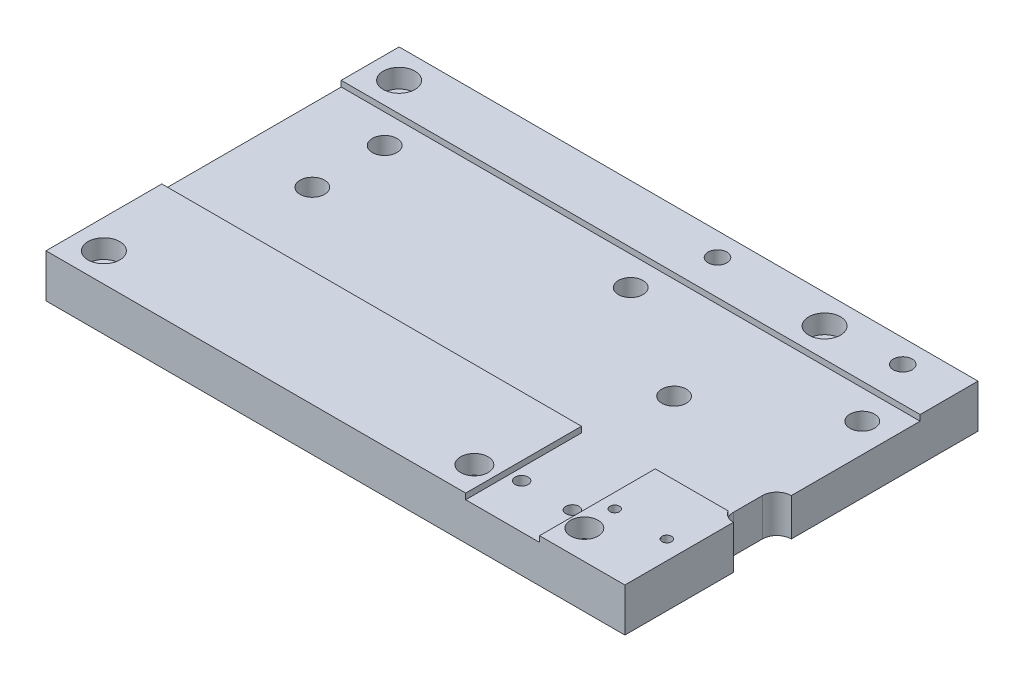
ISO-10303-21;
HEADER;
FILE_DESCRIPTION(('STEP AP214'),'2;1');
FILE_NAME('part.step','',(''),(''),'','','');
FILE_SCHEMA(('AUTOMOTIVE_DESIGN { 1 0 10303 214 1 1 1 1 }'));
ENDSEC;
DATA;
#1=APPLICATION_CONTEXT('core data for automotive mechanical design processes');
#2=APPLICATION_PROTOCOL_DEFINITION('international standard','automotive_design',2000,#1);
#3=PRODUCT_CONTEXT('',#1,'mechanical');
#4=PRODUCT('Part','Part','',(#3));
#5=PRODUCT_RELATED_PRODUCT_CATEGORY('part','',(#4));
#6=PRODUCT_DEFINITION_FORMATION('','',#4);
#7=PRODUCT_DEFINITION_CONTEXT('part definition',#1,'design');
#8=PRODUCT_DEFINITION('design','',#6,#7);
#9=PRODUCT_DEFINITION_SHAPE('','',#8);
#10=(LENGTH_UNIT() NAMED_UNIT(*) SI_UNIT(.MILLI.,.METRE.));
#11=(NAMED_UNIT(*) PLANE_ANGLE_UNIT() SI_UNIT($,.RADIAN.));
#12=(NAMED_UNIT(*) SI_UNIT($,.STERADIAN.) SOLID_ANGLE_UNIT());
#13=UNCERTAINTY_MEASURE_WITH_UNIT(LENGTH_MEASURE(1.E-05),#10,'distance_accuracy_value','');
#14=(GEOMETRIC_REPRESENTATION_CONTEXT(3) GLOBAL_UNCERTAINTY_ASSIGNED_CONTEXT((#13)) GLOBAL_UNIT_ASSIGNED_CONTEXT((#10,
#11,#12)) REPRESENTATION_CONTEXT('',''));
#15=CARTESIAN_POINT('',(0.,0.,0.));
#16=DIRECTION('',(0.,0.,1.));
#17=DIRECTION('',(1.,0.,0.));
#18=AXIS2_PLACEMENT_3D('',#15,#16,#17);
#19=CARTESIAN_POINT('',(166.5,0.,106.65));
#20=DIRECTION('',(0.,1.,0.));
#21=DIRECTION('',(0.,0.,1.));
#22=AXIS2_PLACEMENT_3D('',#19,#20,#21);
#23=CYLINDRICAL_SURFACE('',#22,2.25);
#24=CARTESIAN_POINT('',(166.5,13.,106.65));
#25=DIRECTION('',(0.,-1.,0.));
#26=DIRECTION('',(0.,0.,-1.));
#27=AXIS2_PLACEMENT_3D('',#24,#25,#26);
#28=CIRCLE('',#27,2.25);
#29=CARTESIAN_POINT('',(166.5,13.,104.4));
#30=VERTEX_POINT('',#29);
#31=EDGE_CURVE('E183',#30,#30,#28,.T.);
#32=ORIENTED_EDGE('',*,*,#31,.F.);
#33=EDGE_LOOP('',(#32));
#34=FACE_BOUND('',#33,.T.);
#35=CARTESIAN_POINT('',(166.5,6.5,106.65));
#36=DIRECTION('',(0.,-1.,0.));
#37=DIRECTION('',(0.,0.,-1.));
#38=AXIS2_PLACEMENT_3D('',#35,#36,#37);
#39=CIRCLE('',#38,2.25);
#40=CARTESIAN_POINT('',(166.5,6.5,104.4));
#41=VERTEX_POINT('',#40);
#42=EDGE_CURVE('E36',#41,#41,#39,.F.);
#43=ORIENTED_EDGE('',*,*,#42,.F.);
#44=EDGE_LOOP('',(#43));
#45=FACE_BOUND('',#44,.T.);
#46=ADVANCED_FACE('F32',(#34,#45),#23,.F.);
#47=CARTESIAN_POINT('',(149.,0.,106.65));
#48=DIRECTION('',(0.,1.,0.));
#49=DIRECTION('',(0.,0.,1.));
#50=AXIS2_PLACEMENT_3D('',#47,#48,#49);
#51=CYLINDRICAL_SURFACE('',#50,2.25);
#52=CARTESIAN_POINT('',(149.,13.,106.65));
#53=DIRECTION('',(0.,-1.,0.));
#54=DIRECTION('',(0.,0.,-1.));
#55=AXIS2_PLACEMENT_3D('',#52,#53,#54);
#56=CIRCLE('',#55,2.25);
#57=CARTESIAN_POINT('',(149.,13.,104.4));
#58=VERTEX_POINT('',#57);
#59=EDGE_CURVE('E187',#58,#58,#56,.T.);
#60=ORIENTED_EDGE('',*,*,#59,.F.);
#61=EDGE_LOOP('',(#60));
#62=FACE_BOUND('',#61,.T.);
#63=CARTESIAN_POINT('',(149.,6.5,106.65));
#64=DIRECTION('',(0.,-1.,0.));
#65=DIRECTION('',(0.,0.,-1.));
#66=AXIS2_PLACEMENT_3D('',#63,#64,#65);
#67=CIRCLE('',#66,2.25);
#68=CARTESIAN_POINT('',(149.,6.5,104.4));
#69=VERTEX_POINT('',#68);
#70=EDGE_CURVE('E270',#69,#69,#67,.F.);
#71=ORIENTED_EDGE('',*,*,#70,.F.);
#72=EDGE_LOOP('',(#71));
#73=FACE_BOUND('',#72,.T.);
#74=ADVANCED_FACE('F494',(#62,#73),#51,.F.);
#75=CARTESIAN_POINT('',(182.,0.,8.));
#76=DIRECTION('',(0.,1.,0.));
#77=DIRECTION('',(0.,0.,1.));
#78=AXIS2_PLACEMENT_3D('',#75,#76,#77);
#79=CYLINDRICAL_SURFACE('',#78,3.25);
#80=CARTESIAN_POINT('',(182.,15.,8.));
#81=DIRECTION('',(0.,1.,0.));
#82=DIRECTION('',(0.,0.,1.));
#83=AXIS2_PLACEMENT_3D('',#80,#81,#82);
#84=CIRCLE('',#83,3.25);
#85=CARTESIAN_POINT('',(182.,15.,11.25));
#86=VERTEX_POINT('',#85);
#87=EDGE_CURVE('E203',#86,#86,#84,.T.);
#88=ORIENTED_EDGE('',*,*,#87,.T.);
#89=EDGE_LOOP('',(#88));
#90=FACE_BOUND('',#89,.T.);
#91=CARTESIAN_POINT('',(182.,6.5,8.));
#92=DIRECTION('',(0.,-1.,0.));
#93=DIRECTION('',(0.,0.,-1.));
#94=AXIS2_PLACEMENT_3D('',#91,#92,#93);
#95=CIRCLE('',#94,3.25);
#96=CARTESIAN_POINT('',(182.,6.5,4.75));
#97=VERTEX_POINT('',#96);
#98=EDGE_CURVE('E266',#97,#97,#95,.F.);
#99=ORIENTED_EDGE('',*,*,#98,.F.);
#100=EDGE_LOOP('',(#99));
#101=FACE_BOUND('',#100,.T.);
#102=ADVANCED_FACE('F500',(#90,#101),#79,.F.);
#103=CARTESIAN_POINT('',(190.,0.,30.));
#104=DIRECTION('',(0.,1.,0.));
#105=DIRECTION('',(0.,0.,1.));
#106=AXIS2_PLACEMENT_3D('',#103,#104,#105);
#107=CYLINDRICAL_SURFACE('',#106,4.25);
#108=CARTESIAN_POINT('',(190.,13.,30.));
#109=DIRECTION('',(0.,-1.,0.));
#110=DIRECTION('',(0.,0.,-1.));
#111=AXIS2_PLACEMENT_3D('',#108,#109,#110);
#112=CIRCLE('',#111,4.25);
#113=CARTESIAN_POINT('',(190.,13.,25.75));
#114=VERTEX_POINT('',#113);
#115=EDGE_CURVE('E193',#114,#114,#112,.T.);
#116=ORIENTED_EDGE('',*,*,#115,.F.);
#117=EDGE_LOOP('',(#116));
#118=FACE_BOUND('',#117,.T.);
#119=CARTESIAN_POINT('',(190.,6.5,30.));
#120=DIRECTION('',(0.,-1.,0.));
#121=DIRECTION('',(0.,0.,-1.));
#122=AXIS2_PLACEMENT_3D('',#119,#120,#121);
#123=CIRCLE('',#122,4.25);
#124=CARTESIAN_POINT('',(190.,6.5,25.75));
#125=VERTEX_POINT('',#124);
#126=EDGE_CURVE('E261',#125,#125,#123,.F.);
#127=ORIENTED_EDGE('',*,*,#126,.F.);
#128=EDGE_LOOP('',(#127));
#129=FACE_BOUND('',#128,.T.);
#130=ADVANCED_FACE('F878',(#118,#129),#107,.F.);
#131=CARTESIAN_POINT('',(150.,0.,55.));
#132=DIRECTION('',(0.,1.,0.));
#133=DIRECTION('',(0.,0.,1.));
#134=AXIS2_PLACEMENT_3D('',#131,#132,#133);
#135=CYLINDRICAL_SURFACE('',#134,4.25);
#136=CARTESIAN_POINT('',(150.,13.,55.));
#137=DIRECTION('',(0.,-1.,0.));
#138=DIRECTION('',(0.,0.,-1.));
#139=AXIS2_PLACEMENT_3D('',#136,#137,#138);
#140=CIRCLE('',#139,4.25);
#141=CARTESIAN_POINT('',(150.,13.,50.75));
#142=VERTEX_POINT('',#141);
#143=EDGE_CURVE('E196',#142,#142,#140,.T.);
#144=ORIENTED_EDGE('',*,*,#143,.F.);
#145=EDGE_LOOP('',(#144));
#146=FACE_BOUND('',#145,.T.);
#147=CARTESIAN_POINT('',(150.,6.5,55.));
#148=DIRECTION('',(0.,-1.,0.));
#149=DIRECTION('',(0.,0.,-1.));
#150=AXIS2_PLACEMENT_3D('',#147,#148,#149);
#151=CIRCLE('',#150,4.25);
#152=CARTESIAN_POINT('',(150.,6.5,50.75));
#153=VERTEX_POINT('',#152);
#154=EDGE_CURVE('E256',#153,#153,#151,.F.);
#155=ORIENTED_EDGE('',*,*,#154,.F.);
#156=EDGE_LOOP('',(#155));
#157=FACE_BOUND('',#156,.T.);
#158=ADVANCED_FACE('F887',(#146,#157),#135,.F.);
#159=CARTESIAN_POINT('',(118.,0.,8.));
#160=DIRECTION('',(0.,1.,0.));
#161=DIRECTION('',(0.,0.,1.));
#162=AXIS2_PLACEMENT_3D('',#159,#160,#161);
#163=CYLINDRICAL_SURFACE('',#162,3.25);
#164=CARTESIAN_POINT('',(118.,15.,8.));
#165=DIRECTION('',(0.,1.,0.));
#166=DIRECTION('',(0.,0.,1.));
#167=AXIS2_PLACEMENT_3D('',#164,#165,#166);
#168=CIRCLE('',#167,3.25);
#169=CARTESIAN_POINT('',(118.,15.,11.25));
#170=VERTEX_POINT('',#169);
#171=EDGE_CURVE('E199',#170,#170,#168,.T.);
#172=ORIENTED_EDGE('',*,*,#171,.T.);
#173=EDGE_LOOP('',(#172));
#174=FACE_BOUND('',#173,.T.);
#175=CARTESIAN_POINT('',(118.,6.5,8.));
#176=DIRECTION('',(0.,-1.,0.));
#177=DIRECTION('',(0.,0.,-1.));
#178=AXIS2_PLACEMENT_3D('',#175,#176,#177);
#179=CIRCLE('',#178,3.25);
#180=CARTESIAN_POINT('',(118.,6.5,4.75));
#181=VERTEX_POINT('',#180);
#182=EDGE_CURVE('E251',#181,#181,#179,.F.);
#183=ORIENTED_EDGE('',*,*,#182,.F.);
#184=EDGE_LOOP('',(#183));
#185=FACE_BOUND('',#184,.T.);
#186=ADVANCED_FACE('F896',(#174,#185),#163,.F.);
#187=CARTESIAN_POINT('',(110.,0.,30.));
#188=DIRECTION('',(0.,1.,0.));
#189=DIRECTION('',(0.,0.,1.));
#190=AXIS2_PLACEMENT_3D('',#187,#188,#189);
#191=CYLINDRICAL_SURFACE('',#190,4.25);
#192=CARTESIAN_POINT('',(110.,13.,30.));
#193=DIRECTION('',(0.,-1.,0.));
#194=DIRECTION('',(0.,0.,-1.));
#195=AXIS2_PLACEMENT_3D('',#192,#193,#194);
#196=CIRCLE('',#195,4.25);
#197=CARTESIAN_POINT('',(110.,13.,25.75));
#198=VERTEX_POINT('',#197);
#199=EDGE_CURVE('E190',#198,#198,#196,.T.);
#200=ORIENTED_EDGE('',*,*,#199,.F.);
#201=EDGE_LOOP('',(#200));
#202=FACE_BOUND('',#201,.T.);
#203=CARTESIAN_POINT('',(110.,6.5,30.));
#204=DIRECTION('',(0.,-1.,0.));
#205=DIRECTION('',(0.,0.,-1.));
#206=AXIS2_PLACEMENT_3D('',#203,#204,#205);
#207=CIRCLE('',#206,4.25);
#208=CARTESIAN_POINT('',(110.,6.5,25.75));
#209=VERTEX_POINT('',#208);
#210=EDGE_CURVE('E246',#209,#209,#207,.F.);
#211=ORIENTED_EDGE('',*,*,#210,.F.);
#212=EDGE_LOOP('',(#211));
#213=FACE_BOUND('',#212,.T.);
#214=ADVANCED_FACE('F905',(#202,#213),#191,.F.);
#215=CARTESIAN_POINT('',(25.,0.,30.));
#216=DIRECTION('',(0.,1.,0.));
#217=DIRECTION('',(0.,0.,1.));
#218=AXIS2_PLACEMENT_3D('',#215,#216,#217);
#219=CYLINDRICAL_SURFACE('',#218,4.25);
#220=CARTESIAN_POINT('',(25.,13.,30.));
#221=DIRECTION('',(0.,-1.,0.));
#222=DIRECTION('',(0.,0.,-1.));
#223=AXIS2_PLACEMENT_3D('',#220,#221,#222);
#224=CIRCLE('',#223,4.25);
#225=CARTESIAN_POINT('',(25.,13.,25.75));
#226=VERTEX_POINT('',#225);
#227=EDGE_CURVE('E200',#226,#226,#224,.T.);
#228=ORIENTED_EDGE('',*,*,#227,.F.);
#229=EDGE_LOOP('',(#228));
#230=FACE_BOUND('',#229,.T.);
#231=CARTESIAN_POINT('',(25.,6.5,30.));
#232=DIRECTION('',(0.,-1.,0.));
#233=DIRECTION('',(0.,0.,-1.));
#234=AXIS2_PLACEMENT_3D('',#231,#232,#233);
#235=CIRCLE('',#234,4.25);
#236=CARTESIAN_POINT('',(25.,6.5,25.75));
#237=VERTEX_POINT('',#236);
#238=EDGE_CURVE('E241',#237,#237,#235,.F.);
#239=ORIENTED_EDGE('',*,*,#238,.F.);
#240=EDGE_LOOP('',(#239));
#241=FACE_BOUND('',#240,.T.);
#242=ADVANCED_FACE('F914',(#230,#241),#219,.F.);
#243=CARTESIAN_POINT('',(25.,0.,55.));
#244=DIRECTION('',(0.,1.,0.));
#245=DIRECTION('',(0.,0.,1.));
#246=AXIS2_PLACEMENT_3D('',#243,#244,#245);
#247=CYLINDRICAL_SURFACE('',#246,4.25);
#248=CARTESIAN_POINT('',(25.,13.,55.));
#249=DIRECTION('',(0.,-1.,0.));
#250=DIRECTION('',(0.,0.,-1.));
#251=AXIS2_PLACEMENT_3D('',#248,#249,#250);
#252=CIRCLE('',#251,4.25);
#253=CARTESIAN_POINT('',(25.,13.,50.75));
#254=VERTEX_POINT('',#253);
#255=EDGE_CURVE('E204',#254,#254,#252,.T.);
#256=ORIENTED_EDGE('',*,*,#255,.F.);
#257=EDGE_LOOP('',(#256));
#258=FACE_BOUND('',#257,.T.);
#259=CARTESIAN_POINT('',(25.,6.5,55.));
#260=DIRECTION('',(0.,-1.,0.));
#261=DIRECTION('',(0.,0.,-1.));
#262=AXIS2_PLACEMENT_3D('',#259,#260,#261);
#263=CIRCLE('',#262,4.25);
#264=CARTESIAN_POINT('',(25.,6.5,50.75));
#265=VERTEX_POINT('',#264);
#266=EDGE_CURVE('E236',#265,#265,#263,.F.);
#267=ORIENTED_EDGE('',*,*,#266,.F.);
#268=EDGE_LOOP('',(#267));
#269=FACE_BOUND('',#268,.T.);
#270=ADVANCED_FACE('F922',(#258,#269),#247,.F.);
#271=CARTESIAN_POINT('',(10.,0.,112.));
#272=DIRECTION('',(0.,1.,0.));
#273=DIRECTION('',(0.,0.,1.));
#274=AXIS2_PLACEMENT_3D('',#271,#272,#273);
#275=CYLINDRICAL_SURFACE('',#274,3.25);
#276=CARTESIAN_POINT('',(10.,0.,112.));
#277=DIRECTION('',(0.,1.,0.));
#278=DIRECTION('',(0.,0.,1.));
#279=AXIS2_PLACEMENT_3D('',#276,#277,#278);
#280=CIRCLE('',#279,3.25);
#281=CARTESIAN_POINT('',(10.,0.,115.25));
#282=VERTEX_POINT('',#281);
#283=EDGE_CURVE('E344',#282,#282,#280,.T.);
#284=ORIENTED_EDGE('',*,*,#283,.F.);
#285=EDGE_LOOP('',(#284));
#286=FACE_BOUND('',#285,.T.);
#287=CARTESIAN_POINT('',(10.,8.5,112.));
#288=DIRECTION('',(0.,1.,0.));
#289=DIRECTION('',(0.,0.,1.));
#290=AXIS2_PLACEMENT_3D('',#287,#288,#289);
#291=CIRCLE('',#290,3.25);
#292=CARTESIAN_POINT('',(10.,8.5,115.25));
#293=VERTEX_POINT('',#292);
#294=EDGE_CURVE('E231',#293,#293,#291,.F.);
#295=ORIENTED_EDGE('',*,*,#294,.F.);
#296=EDGE_LOOP('',(#295));
#297=FACE_BOUND('',#296,.T.);
#298=ADVANCED_FACE('F930',(#286,#297),#275,.F.);
#299=CARTESIAN_POINT('',(10.,0.,10.));
#300=DIRECTION('',(0.,1.,0.));
#301=DIRECTION('',(0.,0.,1.));
#302=AXIS2_PLACEMENT_3D('',#299,#300,#301);
#303=CYLINDRICAL_SURFACE('',#302,3.25);
#304=CARTESIAN_POINT('',(10.,0.,10.));
#305=DIRECTION('',(0.,1.,0.));
#306=DIRECTION('',(0.,0.,1.));
#307=AXIS2_PLACEMENT_3D('',#304,#305,#306);
#308=CIRCLE('',#307,3.25);
#309=CARTESIAN_POINT('',(10.,0.,13.25));
#310=VERTEX_POINT('',#309);
#311=EDGE_CURVE('E349',#310,#310,#308,.T.);
#312=ORIENTED_EDGE('',*,*,#311,.F.);
#313=EDGE_LOOP('',(#312));
#314=FACE_BOUND('',#313,.T.);
#315=CARTESIAN_POINT('',(10.,8.5,10.));
#316=DIRECTION('',(0.,1.,0.));
#317=DIRECTION('',(0.,0.,1.));
#318=AXIS2_PLACEMENT_3D('',#315,#316,#317);
#319=CIRCLE('',#318,3.25);
#320=CARTESIAN_POINT('',(10.,8.5,13.25));
#321=VERTEX_POINT('',#320);
#322=EDGE_CURVE('E226',#321,#321,#319,.F.);
#323=ORIENTED_EDGE('',*,*,#322,.F.);
#324=EDGE_LOOP('',(#323));
#325=FACE_BOUND('',#324,.T.);
#326=ADVANCED_FACE('F959',(#314,#325),#303,.F.);
#327=CARTESIAN_POINT('',(176.,0.,112.));
#328=DIRECTION('',(0.,1.,0.));
#329=DIRECTION('',(0.,0.,1.));
#330=AXIS2_PLACEMENT_3D('',#327,#328,#329);
#331=CYLINDRICAL_SURFACE('',#330,2.75);
#332=CARTESIAN_POINT('',(176.,0.,112.));
#333=DIRECTION('',(0.,1.,0.));
#334=DIRECTION('',(0.,0.,1.));
#335=AXIS2_PLACEMENT_3D('',#332,#333,#334);
#336=CIRCLE('',#335,2.75);
#337=CARTESIAN_POINT('',(176.,0.,114.75));
#338=VERTEX_POINT('',#337);
#339=EDGE_CURVE('E352',#338,#338,#336,.T.);
#340=ORIENTED_EDGE('',*,*,#339,.F.);
#341=EDGE_LOOP('',(#340));
#342=FACE_BOUND('',#341,.T.);
#343=CARTESIAN_POINT('',(176.,8.5,112.));
#344=DIRECTION('',(0.,1.,0.));
#345=DIRECTION('',(0.,0.,1.));
#346=AXIS2_PLACEMENT_3D('',#343,#344,#345);
#347=CIRCLE('',#346,2.75);
#348=CARTESIAN_POINT('',(176.,8.5,114.75));
#349=VERTEX_POINT('',#348);
#350=EDGE_CURVE('E221',#349,#349,#347,.F.);
#351=ORIENTED_EDGE('',*,*,#350,.F.);
#352=EDGE_LOOP('',(#351));
#353=FACE_BOUND('',#352,.T.);
#354=ADVANCED_FACE('F968',(#342,#353),#331,.F.);
#355=CARTESIAN_POINT('',(138.,0.,112.));
#356=DIRECTION('',(0.,1.,0.));
#357=DIRECTION('',(0.,0.,1.));
#358=AXIS2_PLACEMENT_3D('',#355,#356,#357);
#359=CYLINDRICAL_SURFACE('',#358,2.75);
#360=CARTESIAN_POINT('',(138.,0.,112.));
#361=DIRECTION('',(0.,1.,0.));
#362=DIRECTION('',(0.,0.,1.));
#363=AXIS2_PLACEMENT_3D('',#360,#361,#362);
#364=CIRCLE('',#363,2.75);
#365=CARTESIAN_POINT('',(138.,0.,114.75));
#366=VERTEX_POINT('',#365);
#367=EDGE_CURVE('E355',#366,#366,#364,.T.);
#368=ORIENTED_EDGE('',*,*,#367,.F.);
#369=EDGE_LOOP('',(#368));
#370=FACE_BOUND('',#369,.T.);
#371=CARTESIAN_POINT('',(138.,8.5,112.));
#372=DIRECTION('',(0.,1.,0.));
#373=DIRECTION('',(0.,0.,1.));
#374=AXIS2_PLACEMENT_3D('',#371,#372,#373);
#375=CIRCLE('',#374,2.75);
#376=CARTESIAN_POINT('',(138.,8.5,114.75));
#377=VERTEX_POINT('',#376);
#378=EDGE_CURVE('E216',#377,#377,#375,.F.);
#379=ORIENTED_EDGE('',*,*,#378,.F.);
#380=EDGE_LOOP('',(#379));
#381=FACE_BOUND('',#380,.T.);
#382=ADVANCED_FACE('F977',(#370,#381),#359,.F.);
#383=CARTESIAN_POINT('',(157.,0.,10.));
#384=DIRECTION('',(0.,1.,0.));
#385=DIRECTION('',(0.,0.,1.));
#386=AXIS2_PLACEMENT_3D('',#383,#384,#385);
#387=CYLINDRICAL_SURFACE('',#386,3.25);
#388=CARTESIAN_POINT('',(157.,0.,10.));
#389=DIRECTION('',(0.,1.,0.));
#390=DIRECTION('',(0.,0.,1.));
#391=AXIS2_PLACEMENT_3D('',#388,#389,#390);
#392=CIRCLE('',#391,3.25);
#393=CARTESIAN_POINT('',(157.,0.,13.25));
#394=VERTEX_POINT('',#393);
#395=EDGE_CURVE('E358',#394,#394,#392,.T.);
#396=ORIENTED_EDGE('',*,*,#395,.F.);
#397=EDGE_LOOP('',(#396));
#398=FACE_BOUND('',#397,.T.);
#399=CARTESIAN_POINT('',(157.,8.5,10.));
#400=DIRECTION('',(0.,1.,0.));
#401=DIRECTION('',(0.,0.,1.));
#402=AXIS2_PLACEMENT_3D('',#399,#400,#401);
#403=CIRCLE('',#402,3.25);
#404=CARTESIAN_POINT('',(157.,8.5,13.25));
#405=VERTEX_POINT('',#404);
#406=EDGE_CURVE('E211',#405,#405,#403,.F.);
#407=ORIENTED_EDGE('',*,*,#406,.F.);
#408=EDGE_LOOP('',(#407));
#409=FACE_BOUND('',#408,.T.);
#410=ADVANCED_FACE('F492',(#398,#409),#387,.F.);
#411=CARTESIAN_POINT('',(200.,0.,122.));
#412=DIRECTION('',(-1.,0.,0.));
#413=DIRECTION('',(0.,0.,1.));
#414=AXIS2_PLACEMENT_3D('',#411,#412,#413);
#415=PLANE('',#414);
#416=DIRECTION('',(0.,0.,-1.));
#417=VECTOR('',#416,1.);
#418=CARTESIAN_POINT('',(200.,0.,122.));
#419=LINE('',#418,#417);
#420=CARTESIAN_POINT('',(200.,0.,122.));
#421=VERTEX_POINT('',#420);
#422=CARTESIAN_POINT('',(200.,0.,84.5));
#423=VERTEX_POINT('',#422);
#424=EDGE_CURVE('E165',#421,#423,#419,.T.);
#425=ORIENTED_EDGE('',*,*,#424,.T.);
#426=DIRECTION('',(0.,1.,0.));
#427=VECTOR('',#426,1.);
#428=CARTESIAN_POINT('',(200.,0.,84.5));
#429=LINE('',#428,#427);
#430=CARTESIAN_POINT('',(200.,15.,84.5));
#431=VERTEX_POINT('',#430);
#432=EDGE_CURVE('E148',#423,#431,#429,.T.);
#433=ORIENTED_EDGE('',*,*,#432,.T.);
#434=DIRECTION('',(0.,0.,-1.));
#435=VECTOR('',#434,1.);
#436=CARTESIAN_POINT('',(200.,15.,122.));
#437=LINE('',#436,#435);
#438=CARTESIAN_POINT('',(200.,15.,122.));
#439=VERTEX_POINT('',#438);
#440=EDGE_CURVE('E179',#439,#431,#437,.T.);
#441=ORIENTED_EDGE('',*,*,#440,.F.);
#442=DIRECTION('',(0.,1.,0.));
#443=VECTOR('',#442,1.);
#444=CARTESIAN_POINT('',(200.,0.,122.));
#445=LINE('',#444,#443);
#446=EDGE_CURVE('E171',#421,#439,#445,.T.);
#447=ORIENTED_EDGE('',*,*,#446,.F.);
#448=EDGE_LOOP('',(#425,#433,#441,#447));
#449=FACE_BOUND('',#448,.T.);
#450=ADVANCED_FACE('F170',(#449),#415,.F.);
#451=CARTESIAN_POINT('',(0.,15.,122.));
#452=DIRECTION('',(0.,-1.,0.));
#453=DIRECTION('',(0.,0.,-1.));
#454=AXIS2_PLACEMENT_3D('',#451,#452,#453);
#455=PLANE('',#454);
#456=CARTESIAN_POINT('',(10.,15.,112.));
#457=DIRECTION('',(0.,1.,0.));
#458=DIRECTION('',(0.,0.,1.));
#459=AXIS2_PLACEMENT_3D('',#456,#457,#458);
#460=CIRCLE('',#459,5.5);
#461=CARTESIAN_POINT('',(10.,15.,117.5));
#462=VERTEX_POINT('',#461);
#463=EDGE_CURVE('E239',#462,#462,#460,.T.);
#464=ORIENTED_EDGE('',*,*,#463,.F.);
#465=EDGE_LOOP('',(#464));
#466=FACE_BOUND('',#465,.T.);
#467=CARTESIAN_POINT('',(138.,15.,112.));
#468=DIRECTION('',(0.,1.,0.));
#469=DIRECTION('',(0.,0.,1.));
#470=AXIS2_PLACEMENT_3D('',#467,#468,#469);
#471=CIRCLE('',#470,4.75);
#472=CARTESIAN_POINT('',(138.,15.,116.75));
#473=VERTEX_POINT('',#472);
#474=EDGE_CURVE('E224',#473,#473,#471,.T.);
#475=ORIENTED_EDGE('',*,*,#474,.F.);
#476=EDGE_LOOP('',(#475));
#477=FACE_BOUND('',#476,.T.);
#478=DIRECTION('',(-1.,0.,0.));
#479=VECTOR('',#478,1.);
#480=CARTESIAN_POINT('',(0.,15.,122.));
#481=LINE('',#480,#479);
#482=CARTESIAN_POINT('',(145.,15.,122.));
#483=VERTEX_POINT('',#482);
#484=CARTESIAN_POINT('',(0.,15.,122.));
#485=VERTEX_POINT('',#484);
#486=EDGE_CURVE('E424',#483,#485,#481,.T.);
#487=ORIENTED_EDGE('',*,*,#486,.F.);
#488=DIRECTION('',(0.,0.,1.));
#489=VECTOR('',#488,1.);
#490=CARTESIAN_POINT('',(145.,15.,82.));
#491=LINE('',#490,#489);
#492=CARTESIAN_POINT('',(145.,15.,82.));
#493=VERTEX_POINT('',#492);
#494=EDGE_CURVE('E378',#493,#483,#491,.T.);
#495=ORIENTED_EDGE('',*,*,#494,.F.);
#496=DIRECTION('',(-1.,0.,0.));
#497=VECTOR('',#496,1.);
#498=CARTESIAN_POINT('',(0.,15.,82.));
#499=LINE('',#498,#497);
#500=CARTESIAN_POINT('',(0.,15.,82.));
#501=VERTEX_POINT('',#500);
#502=EDGE_CURVE('E410',#493,#501,#499,.T.);
#503=ORIENTED_EDGE('',*,*,#502,.T.);
#504=DIRECTION('',(0.,0.,-1.));
#505=VECTOR('',#504,1.);
#506=CARTESIAN_POINT('',(0.,15.,122.));
#507=LINE('',#506,#505);
#508=EDGE_CURVE('E442',#485,#501,#507,.T.);
#509=ORIENTED_EDGE('',*,*,#508,.F.);
#510=EDGE_LOOP('',(#487,#495,#503,#509));
#511=FACE_BOUND('',#510,.T.);
#512=ADVANCED_FACE('F468',(#466,#477,#511),#455,.F.);
#513=CARTESIAN_POINT('',(0.,13.,82.));
#514=DIRECTION('',(0.,0.,1.));
#515=DIRECTION('',(1.,0.,0.));
#516=AXIS2_PLACEMENT_3D('',#513,#514,#515);
#517=PLANE('',#516);
#518=ORIENTED_EDGE('',*,*,#502,.F.);
#519=DIRECTION('',(0.,1.,0.));
#520=VECTOR('',#519,1.);
#521=CARTESIAN_POINT('',(145.,13.,82.));
#522=LINE('',#521,#520);
#523=CARTESIAN_POINT('',(145.,13.,82.));
#524=VERTEX_POINT('',#523);
#525=EDGE_CURVE('E391',#524,#493,#522,.T.);
#526=ORIENTED_EDGE('',*,*,#525,.F.);
#527=DIRECTION('',(1.,0.,0.));
#528=VECTOR('',#527,1.);
#529=CARTESIAN_POINT('',(0.,13.,82.));
#530=LINE('',#529,#528);
#531=CARTESIAN_POINT('',(0.,13.,82.));
#532=VERTEX_POINT('',#531);
#533=EDGE_CURVE('E411',#532,#524,#530,.T.);
#534=ORIENTED_EDGE('',*,*,#533,.F.);
#535=DIRECTION('',(0.,-1.,0.));
#536=VECTOR('',#535,1.);
#537=CARTESIAN_POINT('',(0.,0.,82.));
#538=LINE('',#537,#536);
#539=EDGE_CURVE('E173',#501,#532,#538,.T.);
#540=ORIENTED_EDGE('',*,*,#539,.F.);
#541=EDGE_LOOP('',(#518,#526,#534,#540));
#542=FACE_BOUND('',#541,.T.);
#543=ADVANCED_FACE('F474',(#542),#517,.F.);
#544=CARTESIAN_POINT('',(10.,15.,10.));
#545=DIRECTION('',(0.,1.,0.));
#546=DIRECTION('',(0.,0.,1.));
#547=AXIS2_PLACEMENT_3D('',#544,#545,#546);
#548=CIRCLE('',#547,5.5);
#549=CARTESIAN_POINT('',(10.,15.,15.5));
#550=VERTEX_POINT('',#549);
#551=EDGE_CURVE('E234',#550,#550,#548,.T.);
#552=ORIENTED_EDGE('',*,*,#551,.F.);
#553=EDGE_LOOP('',(#552));
#554=FACE_BOUND('',#553,.T.);
#555=CARTESIAN_POINT('',(157.,15.,10.));
#556=DIRECTION('',(0.,1.,0.));
#557=DIRECTION('',(0.,0.,1.));
#558=AXIS2_PLACEMENT_3D('',#555,#556,#557);
#559=CIRCLE('',#558,5.50000000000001);
#560=CARTESIAN_POINT('',(157.,15.,15.5));
#561=VERTEX_POINT('',#560);
#562=EDGE_CURVE('E219',#561,#561,#559,.T.);
#563=ORIENTED_EDGE('',*,*,#562,.F.);
#564=EDGE_LOOP('',(#563));
#565=FACE_BOUND('',#564,.T.);
#566=ORIENTED_EDGE('',*,*,#87,.F.);
#567=EDGE_LOOP('',(#566));
#568=FACE_BOUND('',#567,.T.);
#569=ORIENTED_EDGE('',*,*,#171,.F.);
#570=EDGE_LOOP('',(#569));
#571=FACE_BOUND('',#570,.T.);
#572=CARTESIAN_POINT('',(0.,15.,20.));
#573=VERTEX_POINT('',#572);
#574=CARTESIAN_POINT('',(0.,15.,0.));
#575=VERTEX_POINT('',#574);
#576=EDGE_CURVE('E441',#573,#575,#507,.T.);
#577=ORIENTED_EDGE('',*,*,#576,.F.);
#578=DIRECTION('',(1.,0.,0.));
#579=VECTOR('',#578,1.);
#580=CARTESIAN_POINT('',(0.,15.,20.));
#581=LINE('',#580,#579);
#582=CARTESIAN_POINT('',(200.,15.,20.));
#583=VERTEX_POINT('',#582);
#584=EDGE_CURVE('E416',#573,#583,#581,.T.);
#585=ORIENTED_EDGE('',*,*,#584,.T.);
#586=CARTESIAN_POINT('',(200.,15.,0.));
#587=VERTEX_POINT('',#586);
#588=EDGE_CURVE('E444',#583,#587,#437,.T.);
#589=ORIENTED_EDGE('',*,*,#588,.T.);
#590=DIRECTION('',(-1.,0.,0.));
#591=VECTOR('',#590,1.);
#592=CARTESIAN_POINT('',(0.,15.,0.));
#593=LINE('',#592,#591);
#594=EDGE_CURVE('E436',#587,#575,#593,.T.);
#595=ORIENTED_EDGE('',*,*,#594,.T.);
#596=EDGE_LOOP('',(#577,#585,#589,#595));
#597=FACE_BOUND('',#596,.T.);
#598=ADVANCED_FACE('F455',(#554,#565,#568,#571,#597),#455,.F.);
#599=CARTESIAN_POINT('',(0.,0.,122.));
#600=DIRECTION('',(0.,1.,0.));
#601=DIRECTION('',(0.,0.,1.));
#602=AXIS2_PLACEMENT_3D('',#599,#600,#601);
#603=PLANE('',#602);
#604=CARTESIAN_POINT('',(166.5,0.,106.65));
#605=DIRECTION('',(0.,-1.,0.));
#606=DIRECTION('',(0.,0.,-1.));
#607=AXIS2_PLACEMENT_3D('',#604,#605,#606);
#608=CIRCLE('',#607,3.99999999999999);
#609=CARTESIAN_POINT('',(166.5,0.,102.65));
#610=VERTEX_POINT('',#609);
#611=EDGE_CURVE('E286',#610,#610,#608,.T.);
#612=ORIENTED_EDGE('',*,*,#611,.F.);
#613=EDGE_LOOP('',(#612));
#614=FACE_BOUND('',#613,.T.);
#615=CARTESIAN_POINT('',(149.,0.,106.65));
#616=DIRECTION('',(0.,-1.,0.));
#617=DIRECTION('',(0.,0.,-1.));
#618=AXIS2_PLACEMENT_3D('',#615,#616,#617);
#619=CIRCLE('',#618,4.00000000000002);
#620=CARTESIAN_POINT('',(149.,0.,102.65));
#621=VERTEX_POINT('',#620);
#622=EDGE_CURVE('E279',#621,#621,#619,.T.);
#623=ORIENTED_EDGE('',*,*,#622,.F.);
#624=EDGE_LOOP('',(#623));
#625=FACE_BOUND('',#624,.T.);
#626=CARTESIAN_POINT('',(182.,0.,8.));
#627=DIRECTION('',(0.,-1.,0.));
#628=DIRECTION('',(0.,0.,-1.));
#629=AXIS2_PLACEMENT_3D('',#626,#627,#628);
#630=CIRCLE('',#629,5.49999999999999);
#631=CARTESIAN_POINT('',(182.,0.,2.50000000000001));
#632=VERTEX_POINT('',#631);
#633=EDGE_CURVE('E272',#632,#632,#630,.T.);
#634=ORIENTED_EDGE('',*,*,#633,.F.);
#635=EDGE_LOOP('',(#634));
#636=FACE_BOUND('',#635,.T.);
#637=CARTESIAN_POINT('',(190.,0.,30.));
#638=DIRECTION('',(0.,-1.,0.));
#639=DIRECTION('',(0.,0.,-1.));
#640=AXIS2_PLACEMENT_3D('',#637,#638,#639);
#641=CIRCLE('',#640,7.00000000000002);
#642=CARTESIAN_POINT('',(190.,0.,23.));
#643=VERTEX_POINT('',#642);
#644=EDGE_CURVE('E268',#643,#643,#641,.T.);
#645=ORIENTED_EDGE('',*,*,#644,.F.);
#646=EDGE_LOOP('',(#645));
#647=FACE_BOUND('',#646,.T.);
#648=CARTESIAN_POINT('',(150.,0.,55.));
#649=DIRECTION('',(0.,-1.,0.));
#650=DIRECTION('',(0.,0.,-1.));
#651=AXIS2_PLACEMENT_3D('',#648,#649,#650);
#652=CIRCLE('',#651,7.00000000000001);
#653=CARTESIAN_POINT('',(150.,0.,48.));
#654=VERTEX_POINT('',#653);
#655=EDGE_CURVE('E264',#654,#654,#652,.T.);
#656=ORIENTED_EDGE('',*,*,#655,.F.);
#657=EDGE_LOOP('',(#656));
#658=FACE_BOUND('',#657,.T.);
#659=CARTESIAN_POINT('',(118.,0.,8.));
#660=DIRECTION('',(0.,-1.,0.));
#661=DIRECTION('',(0.,0.,-1.));
#662=AXIS2_PLACEMENT_3D('',#659,#660,#661);
#663=CIRCLE('',#662,5.5);
#664=CARTESIAN_POINT('',(118.,0.,2.5));
#665=VERTEX_POINT('',#664);
#666=EDGE_CURVE('E259',#665,#665,#663,.T.);
#667=ORIENTED_EDGE('',*,*,#666,.F.);
#668=EDGE_LOOP('',(#667));
#669=FACE_BOUND('',#668,.T.);
#670=CARTESIAN_POINT('',(110.,0.,30.));
#671=DIRECTION('',(0.,-1.,0.));
#672=DIRECTION('',(0.,0.,-1.));
#673=AXIS2_PLACEMENT_3D('',#670,#671,#672);
#674=CIRCLE('',#673,7.);
#675=CARTESIAN_POINT('',(110.,0.,23.));
#676=VERTEX_POINT('',#675);
#677=EDGE_CURVE('E254',#676,#676,#674,.T.);
#678=ORIENTED_EDGE('',*,*,#677,.F.);
#679=EDGE_LOOP('',(#678));
#680=FACE_BOUND('',#679,.T.);
#681=CARTESIAN_POINT('',(25.,0.,30.));
#682=DIRECTION('',(0.,-1.,0.));
#683=DIRECTION('',(0.,0.,-1.));
#684=AXIS2_PLACEMENT_3D('',#681,#682,#683);
#685=CIRCLE('',#684,7.);
#686=CARTESIAN_POINT('',(25.,0.,23.));
#687=VERTEX_POINT('',#686);
#688=EDGE_CURVE('E249',#687,#687,#685,.T.);
#689=ORIENTED_EDGE('',*,*,#688,.F.);
#690=EDGE_LOOP('',(#689));
#691=FACE_BOUND('',#690,.T.);
#692=CARTESIAN_POINT('',(25.,0.,55.));
#693=DIRECTION('',(0.,-1.,0.));
#694=DIRECTION('',(0.,0.,-1.));
#695=AXIS2_PLACEMENT_3D('',#692,#693,#694);
#696=CIRCLE('',#695,7.);
#697=CARTESIAN_POINT('',(25.,0.,48.));
#698=VERTEX_POINT('',#697);
#699=EDGE_CURVE('E244',#698,#698,#696,.T.);
#700=ORIENTED_EDGE('',*,*,#699,.F.);
#701=EDGE_LOOP('',(#700));
#702=FACE_BOUND('',#701,.T.);
#703=CARTESIAN_POINT('',(175.5,0.,101.));
#704=DIRECTION('',(0.,1.,0.));
#705=DIRECTION('',(0.,0.,1.));
#706=AXIS2_PLACEMENT_3D('',#703,#704,#705);
#707=CIRCLE('',#706,1.65000000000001);
#708=CARTESIAN_POINT('',(175.5,0.,102.65));
#709=VERTEX_POINT('',#708);
#710=EDGE_CURVE('E335',#709,#709,#707,.T.);
#711=ORIENTED_EDGE('',*,*,#710,.T.);
#712=EDGE_LOOP('',(#711));
#713=FACE_BOUND('',#712,.T.);
#714=CARTESIAN_POINT('',(193.5,0.,101.));
#715=DIRECTION('',(0.,1.,0.));
#716=DIRECTION('',(0.,0.,1.));
#717=AXIS2_PLACEMENT_3D('',#714,#715,#716);
#718=CIRCLE('',#717,1.65000000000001);
#719=CARTESIAN_POINT('',(193.5,0.,102.65));
#720=VERTEX_POINT('',#719);
#721=EDGE_CURVE('E341',#720,#720,#718,.T.);
#722=ORIENTED_EDGE('',*,*,#721,.T.);
#723=EDGE_LOOP('',(#722));
#724=FACE_BOUND('',#723,.T.);
#725=ORIENTED_EDGE('',*,*,#283,.T.);
#726=EDGE_LOOP('',(#725));
#727=FACE_BOUND('',#726,.T.);
#728=ORIENTED_EDGE('',*,*,#311,.T.);
#729=EDGE_LOOP('',(#728));
#730=FACE_BOUND('',#729,.T.);
#731=ORIENTED_EDGE('',*,*,#339,.T.);
#732=EDGE_LOOP('',(#731));
#733=FACE_BOUND('',#732,.T.);
#734=ORIENTED_EDGE('',*,*,#367,.T.);
#735=EDGE_LOOP('',(#734));
#736=FACE_BOUND('',#735,.T.);
#737=ORIENTED_EDGE('',*,*,#395,.T.);
#738=EDGE_LOOP('',(#737));
#739=FACE_BOUND('',#738,.T.);
#740=DIRECTION('',(0.,0.,1.));
#741=VECTOR('',#740,1.);
#742=CARTESIAN_POINT('',(195.,0.,79.5));
#743=LINE('',#742,#741);
#744=CARTESIAN_POINT('',(195.,0.,69.5));
#745=VERTEX_POINT('',#744);
#746=CARTESIAN_POINT('',(195.,0.,79.5));
#747=VERTEX_POINT('',#746);
#748=EDGE_CURVE('E160',#745,#747,#743,.T.);
#749=ORIENTED_EDGE('',*,*,#748,.T.);
#750=CARTESIAN_POINT('',(200.,0.,79.5));
#751=DIRECTION('',(0.,1.,0.));
#752=DIRECTION('',(0.,0.,1.));
#753=AXIS2_PLACEMENT_3D('',#750,#751,#752);
#754=CIRCLE('',#753,5.);
#755=EDGE_CURVE('E152',#747,#423,#754,.T.);
#756=ORIENTED_EDGE('',*,*,#755,.T.);
#757=ORIENTED_EDGE('',*,*,#424,.F.);
#758=DIRECTION('',(1.,0.,0.));
#759=VECTOR('',#758,1.);
#760=CARTESIAN_POINT('',(0.,0.,122.));
#761=LINE('',#760,#759);
#762=CARTESIAN_POINT('',(0.,0.,122.));
#763=VERTEX_POINT('',#762);
#764=EDGE_CURVE('E420',#763,#421,#761,.T.);
#765=ORIENTED_EDGE('',*,*,#764,.F.);
#766=DIRECTION('',(0.,0.,-1.));
#767=VECTOR('',#766,1.);
#768=CARTESIAN_POINT('',(0.,0.,122.));
#769=LINE('',#768,#767);
#770=CARTESIAN_POINT('',(0.,0.,0.));
#771=VERTEX_POINT('',#770);
#772=EDGE_CURVE('E430',#763,#771,#769,.T.);
#773=ORIENTED_EDGE('',*,*,#772,.T.);
#774=DIRECTION('',(1.,0.,0.));
#775=VECTOR('',#774,1.);
#776=CARTESIAN_POINT('',(0.,0.,0.));
#777=LINE('',#776,#775);
#778=CARTESIAN_POINT('',(200.,0.,0.));
#779=VERTEX_POINT('',#778);
#780=EDGE_CURVE('E419',#771,#779,#777,.T.);
#781=ORIENTED_EDGE('',*,*,#780,.T.);
#782=CARTESIAN_POINT('',(200.,0.,64.5));
#783=VERTEX_POINT('',#782);
#784=EDGE_CURVE('E174',#783,#779,#419,.T.);
#785=ORIENTED_EDGE('',*,*,#784,.F.);
#786=CARTESIAN_POINT('',(200.,0.,69.5));
#787=DIRECTION('',(0.,1.,0.));
#788=DIRECTION('',(0.,0.,1.));
#789=AXIS2_PLACEMENT_3D('',#786,#787,#788);
#790=CIRCLE('',#789,5.);
#791=EDGE_CURVE('E168',#783,#745,#790,.T.);
#792=ORIENTED_EDGE('',*,*,#791,.T.);
#793=EDGE_LOOP('',(#749,#756,#757,#765,#773,#781,#785,#792));
#794=FACE_BOUND('',#793,.T.);
#795=ADVANCED_FACE('F34',(#614,#625,#636,#647,#658,#669,#680,#691,#702,#713,#724,#727,#730,#733,
#736,#739,#794),#603,.F.);
#796=DIRECTION('',(0.,0.,-1.));
#797=VECTOR('',#796,1.);
#798=CARTESIAN_POINT('',(200.,13.,20.));
#799=LINE('',#798,#797);
#800=CARTESIAN_POINT('',(200.,13.,64.5));
#801=VERTEX_POINT('',#800);
#802=CARTESIAN_POINT('',(200.,13.,20.));
#803=VERTEX_POINT('',#802);
#804=EDGE_CURVE('E401',#801,#803,#799,.T.);
#805=ORIENTED_EDGE('',*,*,#804,.F.);
#806=DIRECTION('',(0.,1.,0.));
#807=VECTOR('',#806,1.);
#808=CARTESIAN_POINT('',(200.,0.,64.5));
#809=LINE('',#808,#807);
#810=EDGE_CURVE('E49',#783,#801,#809,.T.);
#811=ORIENTED_EDGE('',*,*,#810,.F.);
#812=ORIENTED_EDGE('',*,*,#784,.T.);
#813=DIRECTION('',(0.,1.,0.));
#814=VECTOR('',#813,1.);
#815=CARTESIAN_POINT('',(200.,0.,0.));
#816=LINE('',#815,#814);
#817=EDGE_CURVE('E433',#779,#587,#816,.T.);
#818=ORIENTED_EDGE('',*,*,#817,.T.);
#819=ORIENTED_EDGE('',*,*,#588,.F.);
#820=DIRECTION('',(0.,1.,0.));
#821=VECTOR('',#820,1.);
#822=CARTESIAN_POINT('',(200.,23.0831915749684,20.));
#823=LINE('',#822,#821);
#824=EDGE_CURVE('E390',#803,#583,#823,.T.);
#825=ORIENTED_EDGE('',*,*,#824,.F.);
#826=EDGE_LOOP('',(#805,#811,#812,#818,#819,#825));
#827=FACE_BOUND('',#826,.T.);
#828=ADVANCED_FACE('F481',(#827),#415,.F.);
#829=CARTESIAN_POINT('',(176.,15.,112.));
#830=DIRECTION('',(0.,1.,0.));
#831=DIRECTION('',(0.,0.,1.));
#832=AXIS2_PLACEMENT_3D('',#829,#830,#831);
#833=CIRCLE('',#832,4.75);
#834=CARTESIAN_POINT('',(176.,15.,116.75));
#835=VERTEX_POINT('',#834);
#836=EDGE_CURVE('E229',#835,#835,#833,.T.);
#837=ORIENTED_EDGE('',*,*,#836,.F.);
#838=EDGE_LOOP('',(#837));
#839=FACE_BOUND('',#838,.T.);
#840=CARTESIAN_POINT('',(175.5,15.,101.));
#841=DIRECTION('',(0.,1.,0.));
#842=DIRECTION('',(0.,0.,1.));
#843=AXIS2_PLACEMENT_3D('',#840,#841,#842);
#844=CIRCLE('',#843,1.65000000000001);
#845=CARTESIAN_POINT('',(175.5,15.,102.65));
#846=VERTEX_POINT('',#845);
#847=EDGE_CURVE('E214',#846,#846,#844,.T.);
#848=ORIENTED_EDGE('',*,*,#847,.F.);
#849=EDGE_LOOP('',(#848));
#850=FACE_BOUND('',#849,.T.);
#851=CARTESIAN_POINT('',(193.5,15.,101.));
#852=DIRECTION('',(0.,1.,0.));
#853=DIRECTION('',(0.,0.,1.));
#854=AXIS2_PLACEMENT_3D('',#851,#852,#853);
#855=CIRCLE('',#854,1.65000000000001);
#856=CARTESIAN_POINT('',(193.5,15.,102.65));
#857=VERTEX_POINT('',#856);
#858=EDGE_CURVE('E338',#857,#857,#855,.T.);
#859=ORIENTED_EDGE('',*,*,#858,.F.);
#860=EDGE_LOOP('',(#859));
#861=FACE_BOUND('',#860,.T.);
#862=ORIENTED_EDGE('',*,*,#440,.T.);
#863=CARTESIAN_POINT('',(200.,15.,79.5));
#864=DIRECTION('',(0.,1.,0.));
#865=DIRECTION('',(0.,0.,1.));
#866=AXIS2_PLACEMENT_3D('',#863,#864,#865);
#867=CIRCLE('',#866,5.);
#868=CARTESIAN_POINT('',(195.669872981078,15.,82.));
#869=VERTEX_POINT('',#868);
#870=EDGE_CURVE('E155',#869,#431,#867,.T.);
#871=ORIENTED_EDGE('',*,*,#870,.F.);
#872=CARTESIAN_POINT('',(170.5,15.,82.));
#873=VERTEX_POINT('',#872);
#874=EDGE_CURVE('E414',#869,#873,#499,.T.);
#875=ORIENTED_EDGE('',*,*,#874,.T.);
#876=DIRECTION('',(0.,0.,-1.));
#877=VECTOR('',#876,1.);
#878=CARTESIAN_POINT('',(170.5,15.,122.));
#879=LINE('',#878,#877);
#880=CARTESIAN_POINT('',(170.5,15.,122.));
#881=VERTEX_POINT('',#880);
#882=EDGE_CURVE('E186',#881,#873,#879,.T.);
#883=ORIENTED_EDGE('',*,*,#882,.F.);
#884=EDGE_CURVE('E425',#439,#881,#481,.T.);
#885=ORIENTED_EDGE('',*,*,#884,.F.);
#886=EDGE_LOOP('',(#862,#871,#875,#883,#885));
#887=FACE_BOUND('',#886,.T.);
#888=ADVANCED_FACE('F483',(#839,#850,#861,#887),#455,.F.);
#889=CARTESIAN_POINT('',(0.,0.,122.));
#890=DIRECTION('',(1.,0.,0.));
#891=DIRECTION('',(0.,0.,-1.));
#892=AXIS2_PLACEMENT_3D('',#889,#890,#891);
#893=PLANE('',#892);
#894=DIRECTION('',(0.,0.,-1.));
#895=VECTOR('',#894,1.);
#896=CARTESIAN_POINT('',(0.,13.,20.));
#897=LINE('',#896,#895);
#898=CARTESIAN_POINT('',(0.,13.,20.));
#899=VERTEX_POINT('',#898);
#900=EDGE_CURVE('E400',#532,#899,#897,.T.);
#901=ORIENTED_EDGE('',*,*,#900,.T.);
#902=DIRECTION('',(0.,1.,0.));
#903=VECTOR('',#902,1.);
#904=CARTESIAN_POINT('',(0.,23.0831915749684,20.));
#905=LINE('',#904,#903);
#906=EDGE_CURVE('E397',#899,#573,#905,.T.);
#907=ORIENTED_EDGE('',*,*,#906,.T.);
#908=ORIENTED_EDGE('',*,*,#576,.T.);
#909=DIRECTION('',(0.,-1.,0.));
#910=VECTOR('',#909,1.);
#911=CARTESIAN_POINT('',(0.,0.,0.));
#912=LINE('',#911,#910);
#913=EDGE_CURVE('E422',#575,#771,#912,.T.);
#914=ORIENTED_EDGE('',*,*,#913,.T.);
#915=ORIENTED_EDGE('',*,*,#772,.F.);
#916=DIRECTION('',(0.,-1.,0.));
#917=VECTOR('',#916,1.);
#918=CARTESIAN_POINT('',(0.,0.,122.));
#919=LINE('',#918,#917);
#920=EDGE_CURVE('E428',#485,#763,#919,.T.);
#921=ORIENTED_EDGE('',*,*,#920,.F.);
#922=ORIENTED_EDGE('',*,*,#508,.T.);
#923=ORIENTED_EDGE('',*,*,#539,.T.);
#924=EDGE_LOOP('',(#901,#907,#908,#914,#915,#921,#922,#923));
#925=FACE_BOUND('',#924,.T.);
#926=ADVANCED_FACE('F449',(#925),#893,.F.);
#927=CARTESIAN_POINT('',(200.,0.,122.));
#928=DIRECTION('',(0.,0.,1.));
#929=DIRECTION('',(1.,0.,0.));
#930=AXIS2_PLACEMENT_3D('',#927,#928,#929);
#931=PLANE('',#930);
#932=DIRECTION('',(0.,1.,0.));
#933=VECTOR('',#932,1.);
#934=CARTESIAN_POINT('',(145.,13.,122.));
#935=LINE('',#934,#933);
#936=CARTESIAN_POINT('',(145.,13.,122.));
#937=VERTEX_POINT('',#936);
#938=EDGE_CURVE('E387',#937,#483,#935,.T.);
#939=ORIENTED_EDGE('',*,*,#938,.T.);
#940=ORIENTED_EDGE('',*,*,#486,.T.);
#941=ORIENTED_EDGE('',*,*,#920,.T.);
#942=ORIENTED_EDGE('',*,*,#764,.T.);
#943=ORIENTED_EDGE('',*,*,#446,.T.);
#944=ORIENTED_EDGE('',*,*,#884,.T.);
#945=DIRECTION('',(0.,1.,0.));
#946=VECTOR('',#945,1.);
#947=CARTESIAN_POINT('',(170.5,13.,122.));
#948=LINE('',#947,#946);
#949=CARTESIAN_POINT('',(170.5,13.,122.));
#950=VERTEX_POINT('',#949);
#951=EDGE_CURVE('E383',#950,#881,#948,.T.);
#952=ORIENTED_EDGE('',*,*,#951,.F.);
#953=DIRECTION('',(1.,0.,0.));
#954=VECTOR('',#953,1.);
#955=CARTESIAN_POINT('',(145.,13.,122.));
#956=LINE('',#955,#954);
#957=EDGE_CURVE('E376',#937,#950,#956,.T.);
#958=ORIENTED_EDGE('',*,*,#957,.F.);
#959=EDGE_LOOP('',(#939,#940,#941,#942,#943,#944,#952,#958));
#960=FACE_BOUND('',#959,.T.);
#961=ADVANCED_FACE('F463',(#960),#931,.T.);
#962=CARTESIAN_POINT('',(200.,0.,0.));
#963=DIRECTION('',(0.,0.,1.));
#964=DIRECTION('',(1.,0.,0.));
#965=AXIS2_PLACEMENT_3D('',#962,#963,#964);
#966=PLANE('',#965);
#967=ORIENTED_EDGE('',*,*,#780,.F.);
#968=ORIENTED_EDGE('',*,*,#913,.F.);
#969=ORIENTED_EDGE('',*,*,#594,.F.);
#970=ORIENTED_EDGE('',*,*,#817,.F.);
#971=EDGE_LOOP('',(#967,#968,#969,#970));
#972=FACE_BOUND('',#971,.T.);
#973=ADVANCED_FACE('F460',(#972),#966,.F.);
#974=CARTESIAN_POINT('',(0.,23.0831915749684,20.));
#975=DIRECTION('',(0.,0.,-1.));
#976=DIRECTION('',(-1.,0.,0.));
#977=AXIS2_PLACEMENT_3D('',#974,#975,#976);
#978=PLANE('',#977);
#979=ORIENTED_EDGE('',*,*,#906,.F.);
#980=DIRECTION('',(1.,0.,0.));
#981=VECTOR('',#980,1.);
#982=CARTESIAN_POINT('',(0.,13.,20.));
#983=LINE('',#982,#981);
#984=EDGE_CURVE('E407',#899,#803,#983,.T.);
#985=ORIENTED_EDGE('',*,*,#984,.T.);
#986=ORIENTED_EDGE('',*,*,#824,.T.);
#987=ORIENTED_EDGE('',*,*,#584,.F.);
#988=EDGE_LOOP('',(#979,#985,#986,#987));
#989=FACE_BOUND('',#988,.T.);
#990=ADVANCED_FACE('F479',(#989),#978,.F.);
#991=ORIENTED_EDGE('',*,*,#874,.F.);
#992=DIRECTION('',(0.,1.,0.));
#993=VECTOR('',#992,1.);
#994=CARTESIAN_POINT('',(195.669872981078,0.,82.));
#995=LINE('',#994,#993);
#996=CARTESIAN_POINT('',(195.669872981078,13.,82.));
#997=VERTEX_POINT('',#996);
#998=EDGE_CURVE('E207',#869,#997,#995,.F.);
#999=ORIENTED_EDGE('',*,*,#998,.T.);
#1000=CARTESIAN_POINT('',(170.5,13.,82.));
#1001=VERTEX_POINT('',#1000);
#1002=EDGE_CURVE('E404',#1001,#997,#530,.T.);
#1003=ORIENTED_EDGE('',*,*,#1002,.F.);
#1004=DIRECTION('',(0.,1.,0.));
#1005=VECTOR('',#1004,1.);
#1006=CARTESIAN_POINT('',(170.5,13.,82.));
#1007=LINE('',#1006,#1005);
#1008=EDGE_CURVE('E393',#1001,#873,#1007,.T.);
#1009=ORIENTED_EDGE('',*,*,#1008,.T.);
#1010=EDGE_LOOP('',(#991,#999,#1003,#1009));
#1011=FACE_BOUND('',#1010,.T.);
#1012=ADVANCED_FACE('F517',(#1011),#517,.F.);
#1013=CARTESIAN_POINT('',(0.,13.,20.));
#1014=DIRECTION('',(0.,-1.,0.));
#1015=DIRECTION('',(0.,0.,-1.));
#1016=AXIS2_PLACEMENT_3D('',#1013,#1014,#1015);
#1017=PLANE('',#1016);
#1018=ORIENTED_EDGE('',*,*,#255,.T.);
#1019=EDGE_LOOP('',(#1018));
#1020=FACE_BOUND('',#1019,.T.);
#1021=ORIENTED_EDGE('',*,*,#227,.T.);
#1022=EDGE_LOOP('',(#1021));
#1023=FACE_BOUND('',#1022,.T.);
#1024=ORIENTED_EDGE('',*,*,#143,.T.);
#1025=EDGE_LOOP('',(#1024));
#1026=FACE_BOUND('',#1025,.T.);
#1027=ORIENTED_EDGE('',*,*,#115,.T.);
#1028=EDGE_LOOP('',(#1027));
#1029=FACE_BOUND('',#1028,.T.);
#1030=ORIENTED_EDGE('',*,*,#199,.T.);
#1031=EDGE_LOOP('',(#1030));
#1032=FACE_BOUND('',#1031,.T.);
#1033=ORIENTED_EDGE('',*,*,#59,.T.);
#1034=EDGE_LOOP('',(#1033));
#1035=FACE_BOUND('',#1034,.T.);
#1036=ORIENTED_EDGE('',*,*,#31,.T.);
#1037=EDGE_LOOP('',(#1036));
#1038=FACE_BOUND('',#1037,.T.);
#1039=ORIENTED_EDGE('',*,*,#1002,.T.);
#1040=CARTESIAN_POINT('',(200.,13.,79.5));
#1041=DIRECTION('',(0.,-1.,0.));
#1042=DIRECTION('',(0.,0.,-1.));
#1043=AXIS2_PLACEMENT_3D('',#1040,#1041,#1042);
#1044=CIRCLE('',#1043,5.);
#1045=CARTESIAN_POINT('',(195.,13.,79.5));
#1046=VERTEX_POINT('',#1045);
#1047=EDGE_CURVE('E11',#997,#1046,#1044,.T.);
#1048=ORIENTED_EDGE('',*,*,#1047,.T.);
#1049=DIRECTION('',(0.,0.,-1.));
#1050=VECTOR('',#1049,1.);
#1051=CARTESIAN_POINT('',(195.,13.,20.));
#1052=LINE('',#1051,#1050);
#1053=CARTESIAN_POINT('',(195.,13.,69.5));
#1054=VERTEX_POINT('',#1053);
#1055=EDGE_CURVE('E41',#1046,#1054,#1052,.T.);
#1056=ORIENTED_EDGE('',*,*,#1055,.T.);
#1057=CARTESIAN_POINT('',(200.,13.,69.5));
#1058=DIRECTION('',(0.,-1.,0.));
#1059=DIRECTION('',(0.,0.,-1.));
#1060=AXIS2_PLACEMENT_3D('',#1057,#1058,#1059);
#1061=CIRCLE('',#1060,5.);
#1062=EDGE_CURVE('E177',#1054,#801,#1061,.T.);
#1063=ORIENTED_EDGE('',*,*,#1062,.T.);
#1064=ORIENTED_EDGE('',*,*,#804,.T.);
#1065=ORIENTED_EDGE('',*,*,#984,.F.);
#1066=ORIENTED_EDGE('',*,*,#900,.F.);
#1067=ORIENTED_EDGE('',*,*,#533,.T.);
#1068=DIRECTION('',(0.,0.,1.));
#1069=VECTOR('',#1068,1.);
#1070=CARTESIAN_POINT('',(145.,13.,82.));
#1071=LINE('',#1070,#1069);
#1072=EDGE_CURVE('E380',#524,#937,#1071,.T.);
#1073=ORIENTED_EDGE('',*,*,#1072,.T.);
#1074=ORIENTED_EDGE('',*,*,#957,.T.);
#1075=DIRECTION('',(0.,0.,-1.));
#1076=VECTOR('',#1075,1.);
#1077=CARTESIAN_POINT('',(170.5,13.,122.));
#1078=LINE('',#1077,#1076);
#1079=EDGE_CURVE('E57',#950,#1001,#1078,.T.);
#1080=ORIENTED_EDGE('',*,*,#1079,.T.);
#1081=EDGE_LOOP('',(#1039,#1048,#1056,#1063,#1064,#1065,#1066,#1067,#1073,#1074,#1080));
#1082=FACE_BOUND('',#1081,.T.);
#1083=ADVANCED_FACE('F475',(#1020,#1023,#1026,#1029,#1032,#1035,#1038,#1082),#1017,.F.);
#1084=CARTESIAN_POINT('',(145.,13.,82.));
#1085=DIRECTION('',(-1.,0.,0.));
#1086=DIRECTION('',(0.,0.,1.));
#1087=AXIS2_PLACEMENT_3D('',#1084,#1085,#1086);
#1088=PLANE('',#1087);
#1089=ORIENTED_EDGE('',*,*,#494,.T.);
#1090=ORIENTED_EDGE('',*,*,#938,.F.);
#1091=ORIENTED_EDGE('',*,*,#1072,.F.);
#1092=ORIENTED_EDGE('',*,*,#525,.T.);
#1093=EDGE_LOOP('',(#1089,#1090,#1091,#1092));
#1094=FACE_BOUND('',#1093,.T.);
#1095=ADVANCED_FACE('F507',(#1094),#1088,.F.);
#1096=CARTESIAN_POINT('',(170.5,13.,122.));
#1097=DIRECTION('',(1.,0.,0.));
#1098=DIRECTION('',(0.,0.,-1.));
#1099=AXIS2_PLACEMENT_3D('',#1096,#1097,#1098);
#1100=PLANE('',#1099);
#1101=ORIENTED_EDGE('',*,*,#882,.T.);
#1102=ORIENTED_EDGE('',*,*,#1008,.F.);
#1103=ORIENTED_EDGE('',*,*,#1079,.F.);
#1104=ORIENTED_EDGE('',*,*,#951,.T.);
#1105=EDGE_LOOP('',(#1101,#1102,#1103,#1104));
#1106=FACE_BOUND('',#1105,.T.);
#1107=ADVANCED_FACE('F510',(#1106),#1100,.F.);
#1108=CARTESIAN_POINT('',(200.,0.,79.5));
#1109=DIRECTION('',(0.,1.,0.));
#1110=DIRECTION('',(0.,0.,1.));
#1111=AXIS2_PLACEMENT_3D('',#1108,#1109,#1110);
#1112=CYLINDRICAL_SURFACE('',#1111,5.);
#1113=ORIENTED_EDGE('',*,*,#870,.T.);
#1114=ORIENTED_EDGE('',*,*,#432,.F.);
#1115=ORIENTED_EDGE('',*,*,#755,.F.);
#1116=DIRECTION('',(0.,1.,0.));
#1117=VECTOR('',#1116,1.);
#1118=CARTESIAN_POINT('',(195.,0.,79.5));
#1119=LINE('',#1118,#1117);
#1120=EDGE_CURVE('E364',#747,#1046,#1119,.T.);
#1121=ORIENTED_EDGE('',*,*,#1120,.T.);
#1122=ORIENTED_EDGE('',*,*,#1047,.F.);
#1123=ORIENTED_EDGE('',*,*,#998,.F.);
#1124=EDGE_LOOP('',(#1113,#1114,#1115,#1121,#1122,#1123));
#1125=FACE_BOUND('',#1124,.T.);
#1126=ADVANCED_FACE('F150',(#1125),#1112,.F.);
#1127=CARTESIAN_POINT('',(195.,0.,79.5));
#1128=DIRECTION('',(-1.,0.,0.));
#1129=DIRECTION('',(0.,0.,1.));
#1130=AXIS2_PLACEMENT_3D('',#1127,#1128,#1129);
#1131=PLANE('',#1130);
#1132=ORIENTED_EDGE('',*,*,#1120,.F.);
#1133=ORIENTED_EDGE('',*,*,#748,.F.);
#1134=DIRECTION('',(0.,1.,0.));
#1135=VECTOR('',#1134,1.);
#1136=CARTESIAN_POINT('',(195.,0.,69.5));
#1137=LINE('',#1136,#1135);
#1138=EDGE_CURVE('E366',#745,#1054,#1137,.T.);
#1139=ORIENTED_EDGE('',*,*,#1138,.T.);
#1140=ORIENTED_EDGE('',*,*,#1055,.F.);
#1141=EDGE_LOOP('',(#1132,#1133,#1139,#1140));
#1142=FACE_BOUND('',#1141,.T.);
#1143=ADVANCED_FACE('F569',(#1142),#1131,.F.);
#1144=CARTESIAN_POINT('',(200.,0.,69.5));
#1145=DIRECTION('',(0.,1.,0.));
#1146=DIRECTION('',(0.,0.,1.));
#1147=AXIS2_PLACEMENT_3D('',#1144,#1145,#1146);
#1148=CYLINDRICAL_SURFACE('',#1147,5.);
#1149=ORIENTED_EDGE('',*,*,#1138,.F.);
#1150=ORIENTED_EDGE('',*,*,#791,.F.);
#1151=ORIENTED_EDGE('',*,*,#810,.T.);
#1152=ORIENTED_EDGE('',*,*,#1062,.F.);
#1153=EDGE_LOOP('',(#1149,#1150,#1151,#1152));
#1154=FACE_BOUND('',#1153,.T.);
#1155=ADVANCED_FACE('F576',(#1154),#1148,.F.);
#1156=CARTESIAN_POINT('',(193.5,0.,101.));
#1157=DIRECTION('',(0.,1.,0.));
#1158=DIRECTION('',(0.,0.,1.));
#1159=AXIS2_PLACEMENT_3D('',#1156,#1157,#1158);
#1160=CYLINDRICAL_SURFACE('',#1159,1.65000000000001);
#1161=ORIENTED_EDGE('',*,*,#721,.F.);
#1162=EDGE_LOOP('',(#1161));
#1163=FACE_BOUND('',#1162,.T.);
#1164=ORIENTED_EDGE('',*,*,#858,.T.);
#1165=EDGE_LOOP('',(#1164));
#1166=FACE_BOUND('',#1165,.T.);
#1167=ADVANCED_FACE('F584',(#1163,#1166),#1160,.F.);
#1168=CARTESIAN_POINT('',(175.5,0.,101.));
#1169=DIRECTION('',(0.,1.,0.));
#1170=DIRECTION('',(0.,0.,1.));
#1171=AXIS2_PLACEMENT_3D('',#1168,#1169,#1170);
#1172=CYLINDRICAL_SURFACE('',#1171,1.65000000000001);
#1173=ORIENTED_EDGE('',*,*,#710,.F.);
#1174=EDGE_LOOP('',(#1173));
#1175=FACE_BOUND('',#1174,.T.);
#1176=ORIENTED_EDGE('',*,*,#847,.T.);
#1177=EDGE_LOOP('',(#1176));
#1178=FACE_BOUND('',#1177,.T.);
#1179=ADVANCED_FACE('F591',(#1175,#1178),#1172,.F.);
#1180=CARTESIAN_POINT('',(157.,8.5,10.));
#1181=DIRECTION('',(0.,1.,0.));
#1182=DIRECTION('',(0.,0.,1.));
#1183=AXIS2_PLACEMENT_3D('',#1180,#1181,#1182);
#1184=PLANE('',#1183);
#1185=CARTESIAN_POINT('',(157.,8.5,10.));
#1186=DIRECTION('',(0.,1.,0.));
#1187=DIRECTION('',(0.,0.,1.));
#1188=AXIS2_PLACEMENT_3D('',#1185,#1186,#1187);
#1189=CIRCLE('',#1188,5.50000000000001);
#1190=CARTESIAN_POINT('',(157.,8.5,15.5));
#1191=VERTEX_POINT('',#1190);
#1192=EDGE_CURVE('E215',#1191,#1191,#1189,.T.);
#1193=ORIENTED_EDGE('',*,*,#1192,.T.);
#1194=EDGE_LOOP('',(#1193));
#1195=FACE_BOUND('',#1194,.T.);
#1196=ORIENTED_EDGE('',*,*,#406,.T.);
#1197=EDGE_LOOP('',(#1196));
#1198=FACE_BOUND('',#1197,.T.);
#1199=ADVANCED_FACE('F599',(#1195,#1198),#1184,.T.);
#1200=CARTESIAN_POINT('',(157.,8.5,10.));
#1201=DIRECTION('',(0.,1.,0.));
#1202=DIRECTION('',(0.,0.,1.));
#1203=AXIS2_PLACEMENT_3D('',#1200,#1201,#1202);
#1204=CYLINDRICAL_SURFACE('',#1203,5.50000000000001);
#1205=CARTESIAN_POINT('',(157.,8.5,15.5));
#1206=CARTESIAN_POINT('',(157.,8.56770833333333,15.5));
#1207=CARTESIAN_POINT('',(157.,8.63541666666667,15.5));
#1208=CARTESIAN_POINT('',(157.,8.77083333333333,15.5));
#1209=CARTESIAN_POINT('',(157.,8.83854166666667,15.5));
#1210=CARTESIAN_POINT('',(157.,8.97395833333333,15.5));
#1211=CARTESIAN_POINT('',(157.,9.04166666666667,15.5));
#1212=CARTESIAN_POINT('',(157.,9.17708333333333,15.5));
#1213=CARTESIAN_POINT('',(157.,9.24479166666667,15.5));
#1214=CARTESIAN_POINT('',(157.,9.38020833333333,15.5));
#1215=CARTESIAN_POINT('',(157.,9.44791666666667,15.5));
#1216=CARTESIAN_POINT('',(157.,9.58333333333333,15.5));
#1217=CARTESIAN_POINT('',(157.,9.65104166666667,15.5));
#1218=CARTESIAN_POINT('',(157.,9.78645833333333,15.5));
#1219=CARTESIAN_POINT('',(157.,9.85416666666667,15.5));
#1220=CARTESIAN_POINT('',(157.,9.98958333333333,15.5));
#1221=CARTESIAN_POINT('',(157.,10.0572916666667,15.5));
#1222=CARTESIAN_POINT('',(157.,10.1927083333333,15.5));
#1223=CARTESIAN_POINT('',(157.,10.2604166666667,15.5));
#1224=CARTESIAN_POINT('',(157.,10.3958333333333,15.5));
#1225=CARTESIAN_POINT('',(157.,10.4635416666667,15.5));
#1226=CARTESIAN_POINT('',(157.,10.5989583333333,15.5));
#1227=CARTESIAN_POINT('',(157.,10.6666666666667,15.5));
#1228=CARTESIAN_POINT('',(157.,10.8020833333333,15.5));
#1229=CARTESIAN_POINT('',(157.,10.8697916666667,15.5));
#1230=CARTESIAN_POINT('',(157.,11.0052083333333,15.5));
#1231=CARTESIAN_POINT('',(157.,11.0729166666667,15.5));
#1232=CARTESIAN_POINT('',(157.,11.2083333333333,15.5));
#1233=CARTESIAN_POINT('',(157.,11.2760416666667,15.5));
#1234=CARTESIAN_POINT('',(157.,11.4114583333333,15.5));
#1235=CARTESIAN_POINT('',(157.,11.4791666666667,15.5));
#1236=CARTESIAN_POINT('',(157.,11.6145833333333,15.5));
#1237=CARTESIAN_POINT('',(157.,11.6822916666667,15.5));
#1238=CARTESIAN_POINT('',(157.,11.8177083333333,15.5));
#1239=CARTESIAN_POINT('',(157.,11.8854166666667,15.5));
#1240=CARTESIAN_POINT('',(157.,12.0208333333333,15.5));
#1241=CARTESIAN_POINT('',(157.,12.0885416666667,15.5));
#1242=CARTESIAN_POINT('',(157.,12.2239583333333,15.5));
#1243=CARTESIAN_POINT('',(157.,12.2916666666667,15.5));
#1244=CARTESIAN_POINT('',(157.,12.4270833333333,15.5));
#1245=CARTESIAN_POINT('',(157.,12.4947916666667,15.5));
#1246=CARTESIAN_POINT('',(157.,12.6302083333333,15.5));
#1247=CARTESIAN_POINT('',(157.,12.6979166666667,15.5));
#1248=CARTESIAN_POINT('',(157.,12.8333333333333,15.5));
#1249=CARTESIAN_POINT('',(157.,12.9010416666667,15.5));
#1250=CARTESIAN_POINT('',(157.,13.0364583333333,15.5));
#1251=CARTESIAN_POINT('',(157.,13.1041666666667,15.5));
#1252=CARTESIAN_POINT('',(157.,13.2395833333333,15.5));
#1253=CARTESIAN_POINT('',(157.,13.3072916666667,15.5));
#1254=CARTESIAN_POINT('',(157.,13.4427083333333,15.5));
#1255=CARTESIAN_POINT('',(157.,13.5104166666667,15.5));
#1256=CARTESIAN_POINT('',(157.,13.6458333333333,15.5));
#1257=CARTESIAN_POINT('',(157.,13.7135416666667,15.5));
#1258=CARTESIAN_POINT('',(157.,13.8489583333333,15.5));
#1259=CARTESIAN_POINT('',(157.,13.9166666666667,15.5));
#1260=CARTESIAN_POINT('',(157.,14.0520833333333,15.5));
#1261=CARTESIAN_POINT('',(157.,14.1197916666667,15.5));
#1262=CARTESIAN_POINT('',(157.,14.2552083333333,15.5));
#1263=CARTESIAN_POINT('',(157.,14.3229166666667,15.5));
#1264=CARTESIAN_POINT('',(157.,14.4583333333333,15.5));
#1265=CARTESIAN_POINT('',(157.,14.5260416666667,15.5));
#1266=CARTESIAN_POINT('',(157.,14.6614583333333,15.5));
#1267=CARTESIAN_POINT('',(157.,14.7291666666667,15.5));
#1268=CARTESIAN_POINT('',(157.,14.8645833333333,15.5));
#1269=CARTESIAN_POINT('',(157.,14.9322916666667,15.5));
#1270=CARTESIAN_POINT('',(157.,15.,15.5));
#1271=B_SPLINE_CURVE_WITH_KNOTS('',3,(#1205,#1206,#1207,#1208,#1209,#1210,#1211,#1212,#1213,
#1214,#1215,#1216,#1217,#1218,#1219,#1220,#1221,#1222,#1223,#1224,#1225,#1226,#1227,#1228,#1229,
#1230,#1231,#1232,#1233,#1234,#1235,#1236,#1237,#1238,#1239,#1240,#1241,#1242,#1243,#1244,#1245,
#1246,#1247,#1248,#1249,#1250,#1251,#1252,#1253,#1254,#1255,#1256,#1257,#1258,#1259,#1260,#1261,
#1262,#1263,#1264,#1265,#1266,#1267,#1268,#1269,#1270),.UNSPECIFIED.,.F.,.F.,(4,2,2,2,2,2,2,2,2,
2,2,2,2,2,2,2,2,2,2,2,2,2,2,2,2,2,2,2,2,2,2,2,4),(0.,0.203125,0.40625,0.609375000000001,
0.812500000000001,1.015625,1.21875,1.421875,1.625,1.828125,2.03125,2.234375,2.4375,2.640625,
2.84375,3.046875,3.25,3.453125,3.65625,3.859375,4.0625,4.265625,4.46875,4.671875,4.875,5.078125,
5.28125,5.484375,5.6875,5.890625,6.09375,6.296875,6.5),.UNSPECIFIED.);
#1272=EDGE_CURVE('BSEAM608',#1191,#561,#1271,.T.);
#1273=ORIENTED_EDGE('',*,*,#1192,.F.);
#1274=ORIENTED_EDGE('',*,*,#562,.T.);
#1275=ORIENTED_EDGE('',*,*,#1272,.T.);
#1276=ORIENTED_EDGE('',*,*,#1272,.F.);
#1277=EDGE_LOOP('',(#1273,#1275,#1274,#1276));
#1278=FACE_BOUND('',#1277,.T.);
#1279=ADVANCED_FACE('F608',(#1278),#1204,.F.);
#1280=CARTESIAN_POINT('',(138.,8.5,112.));
#1281=DIRECTION('',(0.,1.,0.));
#1282=DIRECTION('',(0.,0.,1.));
#1283=AXIS2_PLACEMENT_3D('',#1280,#1281,#1282);
#1284=PLANE('',#1283);
#1285=CARTESIAN_POINT('',(138.,8.5,112.));
#1286=DIRECTION('',(0.,1.,0.));
#1287=DIRECTION('',(0.,0.,1.));
#1288=AXIS2_PLACEMENT_3D('',#1285,#1286,#1287);
#1289=CIRCLE('',#1288,4.75);
#1290=CARTESIAN_POINT('',(138.,8.5,116.75));
#1291=VERTEX_POINT('',#1290);
#1292=EDGE_CURVE('E220',#1291,#1291,#1289,.T.);
#1293=ORIENTED_EDGE('',*,*,#1292,.T.);
#1294=EDGE_LOOP('',(#1293));
#1295=FACE_BOUND('',#1294,.T.);
#1296=ORIENTED_EDGE('',*,*,#378,.T.);
#1297=EDGE_LOOP('',(#1296));
#1298=FACE_BOUND('',#1297,.T.);
#1299=ADVANCED_FACE('F616',(#1295,#1298),#1284,.T.);
#1300=CARTESIAN_POINT('',(138.,8.5,112.));
#1301=DIRECTION('',(0.,1.,0.));
#1302=DIRECTION('',(0.,0.,1.));
#1303=AXIS2_PLACEMENT_3D('',#1300,#1301,#1302);
#1304=CYLINDRICAL_SURFACE('',#1303,4.75);
#1305=CARTESIAN_POINT('',(138.,8.5,116.75));
#1306=CARTESIAN_POINT('',(138.,8.56770833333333,116.75));
#1307=CARTESIAN_POINT('',(138.,8.63541666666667,116.75));
#1308=CARTESIAN_POINT('',(138.,8.77083333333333,116.75));
#1309=CARTESIAN_POINT('',(138.,8.83854166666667,116.75));
#1310=CARTESIAN_POINT('',(138.,8.97395833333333,116.75));
#1311=CARTESIAN_POINT('',(138.,9.04166666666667,116.75));
#1312=CARTESIAN_POINT('',(138.,9.17708333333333,116.75));
#1313=CARTESIAN_POINT('',(138.,9.24479166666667,116.75));
#1314=CARTESIAN_POINT('',(138.,9.38020833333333,116.75));
#1315=CARTESIAN_POINT('',(138.,9.44791666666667,116.75));
#1316=CARTESIAN_POINT('',(138.,9.58333333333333,116.75));
#1317=CARTESIAN_POINT('',(138.,9.65104166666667,116.75));
#1318=CARTESIAN_POINT('',(138.,9.78645833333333,116.75));
#1319=CARTESIAN_POINT('',(138.,9.85416666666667,116.75));
#1320=CARTESIAN_POINT('',(138.,9.98958333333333,116.75));
#1321=CARTESIAN_POINT('',(138.,10.0572916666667,116.75));
#1322=CARTESIAN_POINT('',(138.,10.1927083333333,116.75));
#1323=CARTESIAN_POINT('',(138.,10.2604166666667,116.75));
#1324=CARTESIAN_POINT('',(138.,10.3958333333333,116.75));
#1325=CARTESIAN_POINT('',(138.,10.4635416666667,116.75));
#1326=CARTESIAN_POINT('',(138.,10.5989583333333,116.75));
#1327=CARTESIAN_POINT('',(138.,10.6666666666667,116.75));
#1328=CARTESIAN_POINT('',(138.,10.8020833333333,116.75));
#1329=CARTESIAN_POINT('',(138.,10.8697916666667,116.75));
#1330=CARTESIAN_POINT('',(138.,11.0052083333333,116.75));
#1331=CARTESIAN_POINT('',(138.,11.0729166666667,116.75));
#1332=CARTESIAN_POINT('',(138.,11.2083333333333,116.75));
#1333=CARTESIAN_POINT('',(138.,11.2760416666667,116.75));
#1334=CARTESIAN_POINT('',(138.,11.4114583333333,116.75));
#1335=CARTESIAN_POINT('',(138.,11.4791666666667,116.75));
#1336=CARTESIAN_POINT('',(138.,11.6145833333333,116.75));
#1337=CARTESIAN_POINT('',(138.,11.6822916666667,116.75));
#1338=CARTESIAN_POINT('',(138.,11.8177083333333,116.75));
#1339=CARTESIAN_POINT('',(138.,11.8854166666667,116.75));
#1340=CARTESIAN_POINT('',(138.,12.0208333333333,116.75));
#1341=CARTESIAN_POINT('',(138.,12.0885416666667,116.75));
#1342=CARTESIAN_POINT('',(138.,12.2239583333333,116.75));
#1343=CARTESIAN_POINT('',(138.,12.2916666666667,116.75));
#1344=CARTESIAN_POINT('',(138.,12.4270833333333,116.75));
#1345=CARTESIAN_POINT('',(138.,12.4947916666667,116.75));
#1346=CARTESIAN_POINT('',(138.,12.6302083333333,116.75));
#1347=CARTESIAN_POINT('',(138.,12.6979166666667,116.75));
#1348=CARTESIAN_POINT('',(138.,12.8333333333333,116.75));
#1349=CARTESIAN_POINT('',(138.,12.9010416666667,116.75));
#1350=CARTESIAN_POINT('',(138.,13.0364583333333,116.75));
#1351=CARTESIAN_POINT('',(138.,13.1041666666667,116.75));
#1352=CARTESIAN_POINT('',(138.,13.2395833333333,116.75));
#1353=CARTESIAN_POINT('',(138.,13.3072916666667,116.75));
#1354=CARTESIAN_POINT('',(138.,13.4427083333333,116.75));
#1355=CARTESIAN_POINT('',(138.,13.5104166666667,116.75));
#1356=CARTESIAN_POINT('',(138.,13.6458333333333,116.75));
#1357=CARTESIAN_POINT('',(138.,13.7135416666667,116.75));
#1358=CARTESIAN_POINT('',(138.,13.8489583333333,116.75));
#1359=CARTESIAN_POINT('',(138.,13.9166666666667,116.75));
#1360=CARTESIAN_POINT('',(138.,14.0520833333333,116.75));
#1361=CARTESIAN_POINT('',(138.,14.1197916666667,116.75));
#1362=CARTESIAN_POINT('',(138.,14.2552083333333,116.75));
#1363=CARTESIAN_POINT('',(138.,14.3229166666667,116.75));
#1364=CARTESIAN_POINT('',(138.,14.4583333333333,116.75));
#1365=CARTESIAN_POINT('',(138.,14.5260416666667,116.75));
#1366=CARTESIAN_POINT('',(138.,14.6614583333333,116.75));
#1367=CARTESIAN_POINT('',(138.,14.7291666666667,116.75));
#1368=CARTESIAN_POINT('',(138.,14.8645833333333,116.75));
#1369=CARTESIAN_POINT('',(138.,14.9322916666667,116.75));
#1370=CARTESIAN_POINT('',(138.,15.,116.75));
#1371=B_SPLINE_CURVE_WITH_KNOTS('',3,(#1305,#1306,#1307,#1308,#1309,#1310,#1311,#1312,#1313,
#1314,#1315,#1316,#1317,#1318,#1319,#1320,#1321,#1322,#1323,#1324,#1325,#1326,#1327,#1328,#1329,
#1330,#1331,#1332,#1333,#1334,#1335,#1336,#1337,#1338,#1339,#1340,#1341,#1342,#1343,#1344,#1345,
#1346,#1347,#1348,#1349,#1350,#1351,#1352,#1353,#1354,#1355,#1356,#1357,#1358,#1359,#1360,#1361,
#1362,#1363,#1364,#1365,#1366,#1367,#1368,#1369,#1370),.UNSPECIFIED.,.F.,.F.,(4,2,2,2,2,2,2,2,2,
2,2,2,2,2,2,2,2,2,2,2,2,2,2,2,2,2,2,2,2,2,2,2,4),(0.,0.203124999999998,0.406249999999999,
0.609374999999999,0.812499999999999,1.015625,1.21875,1.421875,1.625,1.828125,2.03125,2.234375,
2.4375,2.640625,2.84375,3.046875,3.25,3.453125,3.65625,3.859375,4.0625,4.265625,4.46875,
4.671875,4.875,5.078125,5.28125,5.484375,5.6875,5.890625,6.09375,6.296875,6.5),.UNSPECIFIED.);
#1372=EDGE_CURVE('BSEAM624',#1291,#473,#1371,.T.);
#1373=ORIENTED_EDGE('',*,*,#1292,.F.);
#1374=ORIENTED_EDGE('',*,*,#474,.T.);
#1375=ORIENTED_EDGE('',*,*,#1372,.T.);
#1376=ORIENTED_EDGE('',*,*,#1372,.F.);
#1377=EDGE_LOOP('',(#1373,#1375,#1374,#1376));
#1378=FACE_BOUND('',#1377,.T.);
#1379=ADVANCED_FACE('F624',(#1378),#1304,.F.);
#1380=CARTESIAN_POINT('',(176.,8.5,112.));
#1381=DIRECTION('',(0.,1.,0.));
#1382=DIRECTION('',(0.,0.,1.));
#1383=AXIS2_PLACEMENT_3D('',#1380,#1381,#1382);
#1384=PLANE('',#1383);
#1385=CARTESIAN_POINT('',(176.,8.5,112.));
#1386=DIRECTION('',(0.,1.,0.));
#1387=DIRECTION('',(0.,0.,1.));
#1388=AXIS2_PLACEMENT_3D('',#1385,#1386,#1387);
#1389=CIRCLE('',#1388,4.75);
#1390=CARTESIAN_POINT('',(176.,8.5,116.75));
#1391=VERTEX_POINT('',#1390);
#1392=EDGE_CURVE('E225',#1391,#1391,#1389,.T.);
#1393=ORIENTED_EDGE('',*,*,#1392,.T.);
#1394=EDGE_LOOP('',(#1393));
#1395=FACE_BOUND('',#1394,.T.);
#1396=ORIENTED_EDGE('',*,*,#350,.T.);
#1397=EDGE_LOOP('',(#1396));
#1398=FACE_BOUND('',#1397,.T.);
#1399=ADVANCED_FACE('F632',(#1395,#1398),#1384,.T.);
#1400=CARTESIAN_POINT('',(176.,8.5,112.));
#1401=DIRECTION('',(0.,1.,0.));
#1402=DIRECTION('',(0.,0.,1.));
#1403=AXIS2_PLACEMENT_3D('',#1400,#1401,#1402);
#1404=CYLINDRICAL_SURFACE('',#1403,4.75);
#1405=CARTESIAN_POINT('',(176.,8.5,116.75));
#1406=CARTESIAN_POINT('',(176.,8.56770833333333,116.75));
#1407=CARTESIAN_POINT('',(176.,8.63541666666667,116.75));
#1408=CARTESIAN_POINT('',(176.,8.77083333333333,116.75));
#1409=CARTESIAN_POINT('',(176.,8.83854166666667,116.75));
#1410=CARTESIAN_POINT('',(176.,8.97395833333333,116.75));
#1411=CARTESIAN_POINT('',(176.,9.04166666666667,116.75));
#1412=CARTESIAN_POINT('',(176.,9.17708333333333,116.75));
#1413=CARTESIAN_POINT('',(176.,9.24479166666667,116.75));
#1414=CARTESIAN_POINT('',(176.,9.38020833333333,116.75));
#1415=CARTESIAN_POINT('',(176.,9.44791666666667,116.75));
#1416=CARTESIAN_POINT('',(176.,9.58333333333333,116.75));
#1417=CARTESIAN_POINT('',(176.,9.65104166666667,116.75));
#1418=CARTESIAN_POINT('',(176.,9.78645833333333,116.75));
#1419=CARTESIAN_POINT('',(176.,9.85416666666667,116.75));
#1420=CARTESIAN_POINT('',(176.,9.98958333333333,116.75));
#1421=CARTESIAN_POINT('',(176.,10.0572916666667,116.75));
#1422=CARTESIAN_POINT('',(176.,10.1927083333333,116.75));
#1423=CARTESIAN_POINT('',(176.,10.2604166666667,116.75));
#1424=CARTESIAN_POINT('',(176.,10.3958333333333,116.75));
#1425=CARTESIAN_POINT('',(176.,10.4635416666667,116.75));
#1426=CARTESIAN_POINT('',(176.,10.5989583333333,116.75));
#1427=CARTESIAN_POINT('',(176.,10.6666666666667,116.75));
#1428=CARTESIAN_POINT('',(176.,10.8020833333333,116.75));
#1429=CARTESIAN_POINT('',(176.,10.8697916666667,116.75));
#1430=CARTESIAN_POINT('',(176.,11.0052083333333,116.75));
#1431=CARTESIAN_POINT('',(176.,11.0729166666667,116.75));
#1432=CARTESIAN_POINT('',(176.,11.2083333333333,116.75));
#1433=CARTESIAN_POINT('',(176.,11.2760416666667,116.75));
#1434=CARTESIAN_POINT('',(176.,11.4114583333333,116.75));
#1435=CARTESIAN_POINT('',(176.,11.4791666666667,116.75));
#1436=CARTESIAN_POINT('',(176.,11.6145833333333,116.75));
#1437=CARTESIAN_POINT('',(176.,11.6822916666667,116.75));
#1438=CARTESIAN_POINT('',(176.,11.8177083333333,116.75));
#1439=CARTESIAN_POINT('',(176.,11.8854166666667,116.75));
#1440=CARTESIAN_POINT('',(176.,12.0208333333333,116.75));
#1441=CARTESIAN_POINT('',(176.,12.0885416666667,116.75));
#1442=CARTESIAN_POINT('',(176.,12.2239583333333,116.75));
#1443=CARTESIAN_POINT('',(176.,12.2916666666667,116.75));
#1444=CARTESIAN_POINT('',(176.,12.4270833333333,116.75));
#1445=CARTESIAN_POINT('',(176.,12.4947916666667,116.75));
#1446=CARTESIAN_POINT('',(176.,12.6302083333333,116.75));
#1447=CARTESIAN_POINT('',(176.,12.6979166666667,116.75));
#1448=CARTESIAN_POINT('',(176.,12.8333333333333,116.75));
#1449=CARTESIAN_POINT('',(176.,12.9010416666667,116.75));
#1450=CARTESIAN_POINT('',(176.,13.0364583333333,116.75));
#1451=CARTESIAN_POINT('',(176.,13.1041666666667,116.75));
#1452=CARTESIAN_POINT('',(176.,13.2395833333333,116.75));
#1453=CARTESIAN_POINT('',(176.,13.3072916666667,116.75));
#1454=CARTESIAN_POINT('',(176.,13.4427083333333,116.75));
#1455=CARTESIAN_POINT('',(176.,13.5104166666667,116.75));
#1456=CARTESIAN_POINT('',(176.,13.6458333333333,116.75));
#1457=CARTESIAN_POINT('',(176.,13.7135416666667,116.75));
#1458=CARTESIAN_POINT('',(176.,13.8489583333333,116.75));
#1459=CARTESIAN_POINT('',(176.,13.9166666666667,116.75));
#1460=CARTESIAN_POINT('',(176.,14.0520833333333,116.75));
#1461=CARTESIAN_POINT('',(176.,14.1197916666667,116.75));
#1462=CARTESIAN_POINT('',(176.,14.2552083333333,116.75));
#1463=CARTESIAN_POINT('',(176.,14.3229166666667,116.75));
#1464=CARTESIAN_POINT('',(176.,14.4583333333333,116.75));
#1465=CARTESIAN_POINT('',(176.,14.5260416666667,116.75));
#1466=CARTESIAN_POINT('',(176.,14.6614583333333,116.75));
#1467=CARTESIAN_POINT('',(176.,14.7291666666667,116.75));
#1468=CARTESIAN_POINT('',(176.,14.8645833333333,116.75));
#1469=CARTESIAN_POINT('',(176.,14.9322916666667,116.75));
#1470=CARTESIAN_POINT('',(176.,15.,116.75));
#1471=B_SPLINE_CURVE_WITH_KNOTS('',3,(#1405,#1406,#1407,#1408,#1409,#1410,#1411,#1412,#1413,
#1414,#1415,#1416,#1417,#1418,#1419,#1420,#1421,#1422,#1423,#1424,#1425,#1426,#1427,#1428,#1429,
#1430,#1431,#1432,#1433,#1434,#1435,#1436,#1437,#1438,#1439,#1440,#1441,#1442,#1443,#1444,#1445,
#1446,#1447,#1448,#1449,#1450,#1451,#1452,#1453,#1454,#1455,#1456,#1457,#1458,#1459,#1460,#1461,
#1462,#1463,#1464,#1465,#1466,#1467,#1468,#1469,#1470),.UNSPECIFIED.,.F.,.F.,(4,2,2,2,2,2,2,2,2,
2,2,2,2,2,2,2,2,2,2,2,2,2,2,2,2,2,2,2,2,2,2,2,4),(0.,0.203124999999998,0.406249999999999,
0.609374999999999,0.812499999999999,1.015625,1.21875,1.421875,1.625,1.828125,2.03125,2.234375,
2.4375,2.640625,2.84375,3.046875,3.25,3.453125,3.65625,3.859375,4.0625,4.265625,4.46875,
4.671875,4.875,5.078125,5.28125,5.484375,5.6875,5.890625,6.09375,6.296875,6.5),.UNSPECIFIED.);
#1472=EDGE_CURVE('BSEAM640',#1391,#835,#1471,.T.);
#1473=ORIENTED_EDGE('',*,*,#1392,.F.);
#1474=ORIENTED_EDGE('',*,*,#836,.T.);
#1475=ORIENTED_EDGE('',*,*,#1472,.T.);
#1476=ORIENTED_EDGE('',*,*,#1472,.F.);
#1477=EDGE_LOOP('',(#1473,#1475,#1474,#1476));
#1478=FACE_BOUND('',#1477,.T.);
#1479=ADVANCED_FACE('F640',(#1478),#1404,.F.);
#1480=CARTESIAN_POINT('',(10.,8.5,10.));
#1481=DIRECTION('',(0.,1.,0.));
#1482=DIRECTION('',(0.,0.,1.));
#1483=AXIS2_PLACEMENT_3D('',#1480,#1481,#1482);
#1484=PLANE('',#1483);
#1485=CARTESIAN_POINT('',(10.,8.5,10.));
#1486=DIRECTION('',(0.,1.,0.));
#1487=DIRECTION('',(0.,0.,1.));
#1488=AXIS2_PLACEMENT_3D('',#1485,#1486,#1487);
#1489=CIRCLE('',#1488,5.5);
#1490=CARTESIAN_POINT('',(10.,8.5,15.5));
#1491=VERTEX_POINT('',#1490);
#1492=EDGE_CURVE('E230',#1491,#1491,#1489,.T.);
#1493=ORIENTED_EDGE('',*,*,#1492,.T.);
#1494=EDGE_LOOP('',(#1493));
#1495=FACE_BOUND('',#1494,.T.);
#1496=ORIENTED_EDGE('',*,*,#322,.T.);
#1497=EDGE_LOOP('',(#1496));
#1498=FACE_BOUND('',#1497,.T.);
#1499=ADVANCED_FACE('F648',(#1495,#1498),#1484,.T.);
#1500=CARTESIAN_POINT('',(10.,8.5,10.));
#1501=DIRECTION('',(0.,1.,0.));
#1502=DIRECTION('',(0.,0.,1.));
#1503=AXIS2_PLACEMENT_3D('',#1500,#1501,#1502);
#1504=CYLINDRICAL_SURFACE('',#1503,5.5);
#1505=CARTESIAN_POINT('',(10.,8.5,15.5));
#1506=CARTESIAN_POINT('',(10.,8.56770833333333,15.5));
#1507=CARTESIAN_POINT('',(10.,8.63541666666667,15.5));
#1508=CARTESIAN_POINT('',(10.,8.77083333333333,15.5));
#1509=CARTESIAN_POINT('',(10.,8.83854166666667,15.5));
#1510=CARTESIAN_POINT('',(10.,8.97395833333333,15.5));
#1511=CARTESIAN_POINT('',(10.,9.04166666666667,15.5));
#1512=CARTESIAN_POINT('',(10.,9.17708333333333,15.5));
#1513=CARTESIAN_POINT('',(10.,9.24479166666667,15.5));
#1514=CARTESIAN_POINT('',(10.,9.38020833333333,15.5));
#1515=CARTESIAN_POINT('',(10.,9.44791666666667,15.5));
#1516=CARTESIAN_POINT('',(10.,9.58333333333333,15.5));
#1517=CARTESIAN_POINT('',(10.,9.65104166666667,15.5));
#1518=CARTESIAN_POINT('',(10.,9.78645833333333,15.5));
#1519=CARTESIAN_POINT('',(10.,9.85416666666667,15.5));
#1520=CARTESIAN_POINT('',(10.,9.98958333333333,15.5));
#1521=CARTESIAN_POINT('',(10.,10.0572916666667,15.5));
#1522=CARTESIAN_POINT('',(10.,10.1927083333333,15.5));
#1523=CARTESIAN_POINT('',(10.,10.2604166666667,15.5));
#1524=CARTESIAN_POINT('',(10.,10.3958333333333,15.5));
#1525=CARTESIAN_POINT('',(10.,10.4635416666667,15.5));
#1526=CARTESIAN_POINT('',(10.,10.5989583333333,15.5));
#1527=CARTESIAN_POINT('',(10.,10.6666666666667,15.5));
#1528=CARTESIAN_POINT('',(10.,10.8020833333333,15.5));
#1529=CARTESIAN_POINT('',(10.,10.8697916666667,15.5));
#1530=CARTESIAN_POINT('',(10.,11.0052083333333,15.5));
#1531=CARTESIAN_POINT('',(10.,11.0729166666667,15.5));
#1532=CARTESIAN_POINT('',(10.,11.2083333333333,15.5));
#1533=CARTESIAN_POINT('',(10.,11.2760416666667,15.5));
#1534=CARTESIAN_POINT('',(10.,11.4114583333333,15.5));
#1535=CARTESIAN_POINT('',(10.,11.4791666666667,15.5));
#1536=CARTESIAN_POINT('',(10.,11.6145833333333,15.5));
#1537=CARTESIAN_POINT('',(10.,11.6822916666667,15.5));
#1538=CARTESIAN_POINT('',(10.,11.8177083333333,15.5));
#1539=CARTESIAN_POINT('',(10.,11.8854166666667,15.5));
#1540=CARTESIAN_POINT('',(10.,12.0208333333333,15.5));
#1541=CARTESIAN_POINT('',(10.,12.0885416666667,15.5));
#1542=CARTESIAN_POINT('',(10.,12.2239583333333,15.5));
#1543=CARTESIAN_POINT('',(10.,12.2916666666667,15.5));
#1544=CARTESIAN_POINT('',(10.,12.4270833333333,15.5));
#1545=CARTESIAN_POINT('',(10.,12.4947916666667,15.5));
#1546=CARTESIAN_POINT('',(10.,12.6302083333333,15.5));
#1547=CARTESIAN_POINT('',(10.,12.6979166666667,15.5));
#1548=CARTESIAN_POINT('',(10.,12.8333333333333,15.5));
#1549=CARTESIAN_POINT('',(10.,12.9010416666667,15.5));
#1550=CARTESIAN_POINT('',(10.,13.0364583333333,15.5));
#1551=CARTESIAN_POINT('',(10.,13.1041666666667,15.5));
#1552=CARTESIAN_POINT('',(10.,13.2395833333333,15.5));
#1553=CARTESIAN_POINT('',(10.,13.3072916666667,15.5));
#1554=CARTESIAN_POINT('',(10.,13.4427083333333,15.5));
#1555=CARTESIAN_POINT('',(10.,13.5104166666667,15.5));
#1556=CARTESIAN_POINT('',(10.,13.6458333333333,15.5));
#1557=CARTESIAN_POINT('',(10.,13.7135416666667,15.5));
#1558=CARTESIAN_POINT('',(10.,13.8489583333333,15.5));
#1559=CARTESIAN_POINT('',(10.,13.9166666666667,15.5));
#1560=CARTESIAN_POINT('',(10.,14.0520833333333,15.5));
#1561=CARTESIAN_POINT('',(10.,14.1197916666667,15.5));
#1562=CARTESIAN_POINT('',(10.,14.2552083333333,15.5));
#1563=CARTESIAN_POINT('',(10.,14.3229166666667,15.5));
#1564=CARTESIAN_POINT('',(10.,14.4583333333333,15.5));
#1565=CARTESIAN_POINT('',(10.,14.5260416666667,15.5));
#1566=CARTESIAN_POINT('',(10.,14.6614583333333,15.5));
#1567=CARTESIAN_POINT('',(10.,14.7291666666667,15.5));
#1568=CARTESIAN_POINT('',(10.,14.8645833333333,15.5));
#1569=CARTESIAN_POINT('',(10.,14.9322916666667,15.5));
#1570=CARTESIAN_POINT('',(10.,15.,15.5));
#1571=B_SPLINE_CURVE_WITH_KNOTS('',3,(#1505,#1506,#1507,#1508,#1509,#1510,#1511,#1512,#1513,
#1514,#1515,#1516,#1517,#1518,#1519,#1520,#1521,#1522,#1523,#1524,#1525,#1526,#1527,#1528,#1529,
#1530,#1531,#1532,#1533,#1534,#1535,#1536,#1537,#1538,#1539,#1540,#1541,#1542,#1543,#1544,#1545,
#1546,#1547,#1548,#1549,#1550,#1551,#1552,#1553,#1554,#1555,#1556,#1557,#1558,#1559,#1560,#1561,
#1562,#1563,#1564,#1565,#1566,#1567,#1568,#1569,#1570),.UNSPECIFIED.,.F.,.F.,(4,2,2,2,2,2,2,2,2,
2,2,2,2,2,2,2,2,2,2,2,2,2,2,2,2,2,2,2,2,2,2,2,4),(0.,0.203125,0.40625,0.609375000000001,
0.812500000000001,1.015625,1.21875,1.421875,1.625,1.828125,2.03125,2.234375,2.4375,2.640625,
2.84375,3.046875,3.25,3.453125,3.65625,3.859375,4.0625,4.265625,4.46875,4.671875,4.875,5.078125,
5.28125,5.484375,5.6875,5.890625,6.09375,6.296875,6.5),.UNSPECIFIED.);
#1572=EDGE_CURVE('BSEAM656',#1491,#550,#1571,.T.);
#1573=ORIENTED_EDGE('',*,*,#1492,.F.);
#1574=ORIENTED_EDGE('',*,*,#551,.T.);
#1575=ORIENTED_EDGE('',*,*,#1572,.T.);
#1576=ORIENTED_EDGE('',*,*,#1572,.F.);
#1577=EDGE_LOOP('',(#1573,#1575,#1574,#1576));
#1578=FACE_BOUND('',#1577,.T.);
#1579=ADVANCED_FACE('F656',(#1578),#1504,.F.);
#1580=CARTESIAN_POINT('',(10.,8.5,112.));
#1581=DIRECTION('',(0.,1.,0.));
#1582=DIRECTION('',(0.,0.,1.));
#1583=AXIS2_PLACEMENT_3D('',#1580,#1581,#1582);
#1584=PLANE('',#1583);
#1585=CARTESIAN_POINT('',(10.,8.5,112.));
#1586=DIRECTION('',(0.,1.,0.));
#1587=DIRECTION('',(0.,0.,1.));
#1588=AXIS2_PLACEMENT_3D('',#1585,#1586,#1587);
#1589=CIRCLE('',#1588,5.5);
#1590=CARTESIAN_POINT('',(10.,8.5,117.5));
#1591=VERTEX_POINT('',#1590);
#1592=EDGE_CURVE('E235',#1591,#1591,#1589,.T.);
#1593=ORIENTED_EDGE('',*,*,#1592,.T.);
#1594=EDGE_LOOP('',(#1593));
#1595=FACE_BOUND('',#1594,.T.);
#1596=ORIENTED_EDGE('',*,*,#294,.T.);
#1597=EDGE_LOOP('',(#1596));
#1598=FACE_BOUND('',#1597,.T.);
#1599=ADVANCED_FACE('F664',(#1595,#1598),#1584,.T.);
#1600=CARTESIAN_POINT('',(10.,8.5,112.));
#1601=DIRECTION('',(0.,1.,0.));
#1602=DIRECTION('',(0.,0.,1.));
#1603=AXIS2_PLACEMENT_3D('',#1600,#1601,#1602);
#1604=CYLINDRICAL_SURFACE('',#1603,5.5);
#1605=CARTESIAN_POINT('',(10.,8.5,117.5));
#1606=CARTESIAN_POINT('',(10.,8.56770833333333,117.5));
#1607=CARTESIAN_POINT('',(10.,8.63541666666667,117.5));
#1608=CARTESIAN_POINT('',(10.,8.77083333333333,117.5));
#1609=CARTESIAN_POINT('',(10.,8.83854166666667,117.5));
#1610=CARTESIAN_POINT('',(10.,8.97395833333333,117.5));
#1611=CARTESIAN_POINT('',(10.,9.04166666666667,117.5));
#1612=CARTESIAN_POINT('',(10.,9.17708333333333,117.5));
#1613=CARTESIAN_POINT('',(10.,9.24479166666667,117.5));
#1614=CARTESIAN_POINT('',(10.,9.38020833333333,117.5));
#1615=CARTESIAN_POINT('',(10.,9.44791666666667,117.5));
#1616=CARTESIAN_POINT('',(10.,9.58333333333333,117.5));
#1617=CARTESIAN_POINT('',(10.,9.65104166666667,117.5));
#1618=CARTESIAN_POINT('',(10.,9.78645833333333,117.5));
#1619=CARTESIAN_POINT('',(10.,9.85416666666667,117.5));
#1620=CARTESIAN_POINT('',(10.,9.98958333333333,117.5));
#1621=CARTESIAN_POINT('',(10.,10.0572916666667,117.5));
#1622=CARTESIAN_POINT('',(10.,10.1927083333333,117.5));
#1623=CARTESIAN_POINT('',(10.,10.2604166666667,117.5));
#1624=CARTESIAN_POINT('',(10.,10.3958333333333,117.5));
#1625=CARTESIAN_POINT('',(10.,10.4635416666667,117.5));
#1626=CARTESIAN_POINT('',(10.,10.5989583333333,117.5));
#1627=CARTESIAN_POINT('',(10.,10.6666666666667,117.5));
#1628=CARTESIAN_POINT('',(10.,10.8020833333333,117.5));
#1629=CARTESIAN_POINT('',(10.,10.8697916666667,117.5));
#1630=CARTESIAN_POINT('',(10.,11.0052083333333,117.5));
#1631=CARTESIAN_POINT('',(10.,11.0729166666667,117.5));
#1632=CARTESIAN_POINT('',(10.,11.2083333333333,117.5));
#1633=CARTESIAN_POINT('',(10.,11.2760416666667,117.5));
#1634=CARTESIAN_POINT('',(10.,11.4114583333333,117.5));
#1635=CARTESIAN_POINT('',(10.,11.4791666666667,117.5));
#1636=CARTESIAN_POINT('',(10.,11.6145833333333,117.5));
#1637=CARTESIAN_POINT('',(10.,11.6822916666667,117.5));
#1638=CARTESIAN_POINT('',(10.,11.8177083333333,117.5));
#1639=CARTESIAN_POINT('',(10.,11.8854166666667,117.5));
#1640=CARTESIAN_POINT('',(10.,12.0208333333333,117.5));
#1641=CARTESIAN_POINT('',(10.,12.0885416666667,117.5));
#1642=CARTESIAN_POINT('',(10.,12.2239583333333,117.5));
#1643=CARTESIAN_POINT('',(10.,12.2916666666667,117.5));
#1644=CARTESIAN_POINT('',(10.,12.4270833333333,117.5));
#1645=CARTESIAN_POINT('',(10.,12.4947916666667,117.5));
#1646=CARTESIAN_POINT('',(10.,12.6302083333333,117.5));
#1647=CARTESIAN_POINT('',(10.,12.6979166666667,117.5));
#1648=CARTESIAN_POINT('',(10.,12.8333333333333,117.5));
#1649=CARTESIAN_POINT('',(10.,12.9010416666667,117.5));
#1650=CARTESIAN_POINT('',(10.,13.0364583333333,117.5));
#1651=CARTESIAN_POINT('',(10.,13.1041666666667,117.5));
#1652=CARTESIAN_POINT('',(10.,13.2395833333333,117.5));
#1653=CARTESIAN_POINT('',(10.,13.3072916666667,117.5));
#1654=CARTESIAN_POINT('',(10.,13.4427083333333,117.5));
#1655=CARTESIAN_POINT('',(10.,13.5104166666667,117.5));
#1656=CARTESIAN_POINT('',(10.,13.6458333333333,117.5));
#1657=CARTESIAN_POINT('',(10.,13.7135416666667,117.5));
#1658=CARTESIAN_POINT('',(10.,13.8489583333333,117.5));
#1659=CARTESIAN_POINT('',(10.,13.9166666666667,117.5));
#1660=CARTESIAN_POINT('',(10.,14.0520833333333,117.5));
#1661=CARTESIAN_POINT('',(10.,14.1197916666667,117.5));
#1662=CARTESIAN_POINT('',(10.,14.2552083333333,117.5));
#1663=CARTESIAN_POINT('',(10.,14.3229166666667,117.5));
#1664=CARTESIAN_POINT('',(10.,14.4583333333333,117.5));
#1665=CARTESIAN_POINT('',(10.,14.5260416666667,117.5));
#1666=CARTESIAN_POINT('',(10.,14.6614583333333,117.5));
#1667=CARTESIAN_POINT('',(10.,14.7291666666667,117.5));
#1668=CARTESIAN_POINT('',(10.,14.8645833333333,117.5));
#1669=CARTESIAN_POINT('',(10.,14.9322916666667,117.5));
#1670=CARTESIAN_POINT('',(10.,15.,117.5));
#1671=B_SPLINE_CURVE_WITH_KNOTS('',3,(#1605,#1606,#1607,#1608,#1609,#1610,#1611,#1612,#1613,
#1614,#1615,#1616,#1617,#1618,#1619,#1620,#1621,#1622,#1623,#1624,#1625,#1626,#1627,#1628,#1629,
#1630,#1631,#1632,#1633,#1634,#1635,#1636,#1637,#1638,#1639,#1640,#1641,#1642,#1643,#1644,#1645,
#1646,#1647,#1648,#1649,#1650,#1651,#1652,#1653,#1654,#1655,#1656,#1657,#1658,#1659,#1660,#1661,
#1662,#1663,#1664,#1665,#1666,#1667,#1668,#1669,#1670),.UNSPECIFIED.,.F.,.F.,(4,2,2,2,2,2,2,2,2,
2,2,2,2,2,2,2,2,2,2,2,2,2,2,2,2,2,2,2,2,2,2,2,4),(0.,0.203125,0.40625,0.609375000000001,
0.812500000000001,1.015625,1.21875,1.421875,1.625,1.828125,2.03125,2.234375,2.4375,2.640625,
2.84375,3.046875,3.25,3.453125,3.65625,3.859375,4.0625,4.265625,4.46875,4.671875,4.875,5.078125,
5.28125,5.484375,5.6875,5.890625,6.09375,6.296875,6.5),.UNSPECIFIED.);
#1672=EDGE_CURVE('BSEAM672',#1591,#462,#1671,.T.);
#1673=ORIENTED_EDGE('',*,*,#1592,.F.);
#1674=ORIENTED_EDGE('',*,*,#463,.T.);
#1675=ORIENTED_EDGE('',*,*,#1672,.T.);
#1676=ORIENTED_EDGE('',*,*,#1672,.F.);
#1677=EDGE_LOOP('',(#1673,#1675,#1674,#1676));
#1678=FACE_BOUND('',#1677,.T.);
#1679=ADVANCED_FACE('F672',(#1678),#1604,.F.);
#1680=CARTESIAN_POINT('',(25.,6.5,55.));
#1681=DIRECTION('',(0.,-1.,0.));
#1682=DIRECTION('',(0.,0.,-1.));
#1683=AXIS2_PLACEMENT_3D('',#1680,#1681,#1682);
#1684=PLANE('',#1683);
#1685=CARTESIAN_POINT('',(25.,6.5,55.));
#1686=DIRECTION('',(0.,-1.,0.));
#1687=DIRECTION('',(0.,0.,-1.));
#1688=AXIS2_PLACEMENT_3D('',#1685,#1686,#1687);
#1689=CIRCLE('',#1688,7.);
#1690=CARTESIAN_POINT('',(25.,6.5,48.));
#1691=VERTEX_POINT('',#1690);
#1692=EDGE_CURVE('E240',#1691,#1691,#1689,.T.);
#1693=ORIENTED_EDGE('',*,*,#1692,.T.);
#1694=EDGE_LOOP('',(#1693));
#1695=FACE_BOUND('',#1694,.T.);
#1696=ORIENTED_EDGE('',*,*,#266,.T.);
#1697=EDGE_LOOP('',(#1696));
#1698=FACE_BOUND('',#1697,.T.);
#1699=ADVANCED_FACE('F680',(#1695,#1698),#1684,.T.);
#1700=CARTESIAN_POINT('',(25.,6.5,55.));
#1701=DIRECTION('',(0.,-1.,0.));
#1702=DIRECTION('',(0.,0.,-1.));
#1703=AXIS2_PLACEMENT_3D('',#1700,#1701,#1702);
#1704=CYLINDRICAL_SURFACE('',#1703,7.);
#1705=CARTESIAN_POINT('',(25.,6.5,48.));
#1706=CARTESIAN_POINT('',(25.,6.43229166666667,48.));
#1707=CARTESIAN_POINT('',(25.,6.36458333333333,48.));
#1708=CARTESIAN_POINT('',(25.,6.22916666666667,48.));
#1709=CARTESIAN_POINT('',(25.,6.16145833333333,48.));
#1710=CARTESIAN_POINT('',(25.,6.02604166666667,48.));
#1711=CARTESIAN_POINT('',(25.,5.95833333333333,48.));
#1712=CARTESIAN_POINT('',(25.,5.82291666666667,48.));
#1713=CARTESIAN_POINT('',(25.,5.75520833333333,48.));
#1714=CARTESIAN_POINT('',(25.,5.61979166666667,48.));
#1715=CARTESIAN_POINT('',(25.,5.55208333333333,48.));
#1716=CARTESIAN_POINT('',(25.,5.41666666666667,48.));
#1717=CARTESIAN_POINT('',(25.,5.34895833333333,48.));
#1718=CARTESIAN_POINT('',(25.,5.21354166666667,48.));
#1719=CARTESIAN_POINT('',(25.,5.14583333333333,48.));
#1720=CARTESIAN_POINT('',(25.,5.01041666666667,48.));
#1721=CARTESIAN_POINT('',(25.,4.94270833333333,48.));
#1722=CARTESIAN_POINT('',(25.,4.80729166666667,48.));
#1723=CARTESIAN_POINT('',(25.,4.73958333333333,48.));
#1724=CARTESIAN_POINT('',(25.,4.60416666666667,48.));
#1725=CARTESIAN_POINT('',(25.,4.53645833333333,48.));
#1726=CARTESIAN_POINT('',(25.,4.40104166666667,48.));
#1727=CARTESIAN_POINT('',(25.,4.33333333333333,48.));
#1728=CARTESIAN_POINT('',(25.,4.19791666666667,48.));
#1729=CARTESIAN_POINT('',(25.,4.13020833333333,48.));
#1730=CARTESIAN_POINT('',(25.,3.99479166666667,48.));
#1731=CARTESIAN_POINT('',(25.,3.92708333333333,48.));
#1732=CARTESIAN_POINT('',(25.,3.79166666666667,48.));
#1733=CARTESIAN_POINT('',(25.,3.72395833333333,48.));
#1734=CARTESIAN_POINT('',(25.,3.58854166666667,48.));
#1735=CARTESIAN_POINT('',(25.,3.52083333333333,48.));
#1736=CARTESIAN_POINT('',(25.,3.38541666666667,48.));
#1737=CARTESIAN_POINT('',(25.,3.31770833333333,48.));
#1738=CARTESIAN_POINT('',(25.,3.18229166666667,48.));
#1739=CARTESIAN_POINT('',(25.,3.11458333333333,48.));
#1740=CARTESIAN_POINT('',(25.,2.97916666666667,48.));
#1741=CARTESIAN_POINT('',(25.,2.91145833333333,48.));
#1742=CARTESIAN_POINT('',(25.,2.77604166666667,48.));
#1743=CARTESIAN_POINT('',(25.,2.70833333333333,48.));
#1744=CARTESIAN_POINT('',(25.,2.57291666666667,48.));
#1745=CARTESIAN_POINT('',(25.,2.50520833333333,48.));
#1746=CARTESIAN_POINT('',(25.,2.36979166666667,48.));
#1747=CARTESIAN_POINT('',(25.,2.30208333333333,48.));
#1748=CARTESIAN_POINT('',(25.,2.16666666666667,48.));
#1749=CARTESIAN_POINT('',(25.,2.09895833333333,48.));
#1750=CARTESIAN_POINT('',(25.,1.96354166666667,48.));
#1751=CARTESIAN_POINT('',(25.,1.89583333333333,48.));
#1752=CARTESIAN_POINT('',(25.,1.76041666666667,48.));
#1753=CARTESIAN_POINT('',(25.,1.69270833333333,48.));
#1754=CARTESIAN_POINT('',(25.,1.55729166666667,48.));
#1755=CARTESIAN_POINT('',(25.,1.48958333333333,48.));
#1756=CARTESIAN_POINT('',(25.,1.35416666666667,48.));
#1757=CARTESIAN_POINT('',(25.,1.28645833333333,48.));
#1758=CARTESIAN_POINT('',(25.,1.15104166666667,48.));
#1759=CARTESIAN_POINT('',(25.,1.08333333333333,48.));
#1760=CARTESIAN_POINT('',(25.,0.947916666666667,48.));
#1761=CARTESIAN_POINT('',(25.,0.880208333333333,48.));
#1762=CARTESIAN_POINT('',(25.,0.744791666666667,48.));
#1763=CARTESIAN_POINT('',(25.,0.677083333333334,48.));
#1764=CARTESIAN_POINT('',(25.,0.541666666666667,48.));
#1765=CARTESIAN_POINT('',(25.,0.473958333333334,48.));
#1766=CARTESIAN_POINT('',(25.,0.338541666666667,48.));
#1767=CARTESIAN_POINT('',(25.,0.270833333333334,48.));
#1768=CARTESIAN_POINT('',(25.,0.135416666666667,48.));
#1769=CARTESIAN_POINT('',(25.,0.0677083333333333,48.));
#1770=CARTESIAN_POINT('',(25.,0.,48.));
#1771=B_SPLINE_CURVE_WITH_KNOTS('',3,(#1705,#1706,#1707,#1708,#1709,#1710,#1711,#1712,#1713,
#1714,#1715,#1716,#1717,#1718,#1719,#1720,#1721,#1722,#1723,#1724,#1725,#1726,#1727,#1728,#1729,
#1730,#1731,#1732,#1733,#1734,#1735,#1736,#1737,#1738,#1739,#1740,#1741,#1742,#1743,#1744,#1745,
#1746,#1747,#1748,#1749,#1750,#1751,#1752,#1753,#1754,#1755,#1756,#1757,#1758,#1759,#1760,#1761,
#1762,#1763,#1764,#1765,#1766,#1767,#1768,#1769,#1770),.UNSPECIFIED.,.F.,.F.,(4,2,2,2,2,2,2,2,2,
2,2,2,2,2,2,2,2,2,2,2,2,2,2,2,2,2,2,2,2,2,2,2,4),(0.,0.203125,0.40625,0.609375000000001,
0.812500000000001,1.015625,1.21875,1.421875,1.625,1.828125,2.03125,2.234375,2.4375,2.640625,
2.84375,3.046875,3.25,3.453125,3.65625,3.859375,4.0625,4.265625,4.46875,4.671875,4.875,5.078125,
5.28125,5.484375,5.6875,5.890625,6.09375,6.296875,6.5),.UNSPECIFIED.);
#1772=EDGE_CURVE('BSEAM688',#1691,#698,#1771,.T.);
#1773=ORIENTED_EDGE('',*,*,#1692,.F.);
#1774=ORIENTED_EDGE('',*,*,#699,.T.);
#1775=ORIENTED_EDGE('',*,*,#1772,.T.);
#1776=ORIENTED_EDGE('',*,*,#1772,.F.);
#1777=EDGE_LOOP('',(#1773,#1775,#1774,#1776));
#1778=FACE_BOUND('',#1777,.T.);
#1779=ADVANCED_FACE('F688',(#1778),#1704,.F.);
#1780=CARTESIAN_POINT('',(25.,6.5,30.));
#1781=DIRECTION('',(0.,-1.,0.));
#1782=DIRECTION('',(0.,0.,-1.));
#1783=AXIS2_PLACEMENT_3D('',#1780,#1781,#1782);
#1784=PLANE('',#1783);
#1785=CARTESIAN_POINT('',(25.,6.5,30.));
#1786=DIRECTION('',(0.,-1.,0.));
#1787=DIRECTION('',(0.,0.,-1.));
#1788=AXIS2_PLACEMENT_3D('',#1785,#1786,#1787);
#1789=CIRCLE('',#1788,7.);
#1790=CARTESIAN_POINT('',(25.,6.5,23.));
#1791=VERTEX_POINT('',#1790);
#1792=EDGE_CURVE('E245',#1791,#1791,#1789,.T.);
#1793=ORIENTED_EDGE('',*,*,#1792,.T.);
#1794=EDGE_LOOP('',(#1793));
#1795=FACE_BOUND('',#1794,.T.);
#1796=ORIENTED_EDGE('',*,*,#238,.T.);
#1797=EDGE_LOOP('',(#1796));
#1798=FACE_BOUND('',#1797,.T.);
#1799=ADVANCED_FACE('F697',(#1795,#1798),#1784,.T.);
#1800=CARTESIAN_POINT('',(25.,6.5,30.));
#1801=DIRECTION('',(0.,-1.,0.));
#1802=DIRECTION('',(0.,0.,-1.));
#1803=AXIS2_PLACEMENT_3D('',#1800,#1801,#1802);
#1804=CYLINDRICAL_SURFACE('',#1803,7.);
#1805=CARTESIAN_POINT('',(25.,6.5,23.));
#1806=CARTESIAN_POINT('',(25.,6.43229166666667,23.));
#1807=CARTESIAN_POINT('',(25.,6.36458333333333,23.));
#1808=CARTESIAN_POINT('',(25.,6.22916666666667,23.));
#1809=CARTESIAN_POINT('',(25.,6.16145833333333,23.));
#1810=CARTESIAN_POINT('',(25.,6.02604166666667,23.));
#1811=CARTESIAN_POINT('',(25.,5.95833333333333,23.));
#1812=CARTESIAN_POINT('',(25.,5.82291666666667,23.));
#1813=CARTESIAN_POINT('',(25.,5.75520833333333,23.));
#1814=CARTESIAN_POINT('',(25.,5.61979166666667,23.));
#1815=CARTESIAN_POINT('',(25.,5.55208333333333,23.));
#1816=CARTESIAN_POINT('',(25.,5.41666666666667,23.));
#1817=CARTESIAN_POINT('',(25.,5.34895833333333,23.));
#1818=CARTESIAN_POINT('',(25.,5.21354166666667,23.));
#1819=CARTESIAN_POINT('',(25.,5.14583333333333,23.));
#1820=CARTESIAN_POINT('',(25.,5.01041666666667,23.));
#1821=CARTESIAN_POINT('',(25.,4.94270833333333,23.));
#1822=CARTESIAN_POINT('',(25.,4.80729166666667,23.));
#1823=CARTESIAN_POINT('',(25.,4.73958333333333,23.));
#1824=CARTESIAN_POINT('',(25.,4.60416666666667,23.));
#1825=CARTESIAN_POINT('',(25.,4.53645833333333,23.));
#1826=CARTESIAN_POINT('',(25.,4.40104166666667,23.));
#1827=CARTESIAN_POINT('',(25.,4.33333333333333,23.));
#1828=CARTESIAN_POINT('',(25.,4.19791666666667,23.));
#1829=CARTESIAN_POINT('',(25.,4.13020833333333,23.));
#1830=CARTESIAN_POINT('',(25.,3.99479166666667,23.));
#1831=CARTESIAN_POINT('',(25.,3.92708333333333,23.));
#1832=CARTESIAN_POINT('',(25.,3.79166666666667,23.));
#1833=CARTESIAN_POINT('',(25.,3.72395833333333,23.));
#1834=CARTESIAN_POINT('',(25.,3.58854166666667,23.));
#1835=CARTESIAN_POINT('',(25.,3.52083333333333,23.));
#1836=CARTESIAN_POINT('',(25.,3.38541666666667,23.));
#1837=CARTESIAN_POINT('',(25.,3.31770833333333,23.));
#1838=CARTESIAN_POINT('',(25.,3.18229166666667,23.));
#1839=CARTESIAN_POINT('',(25.,3.11458333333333,23.));
#1840=CARTESIAN_POINT('',(25.,2.97916666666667,23.));
#1841=CARTESIAN_POINT('',(25.,2.91145833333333,23.));
#1842=CARTESIAN_POINT('',(25.,2.77604166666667,23.));
#1843=CARTESIAN_POINT('',(25.,2.70833333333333,23.));
#1844=CARTESIAN_POINT('',(25.,2.57291666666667,23.));
#1845=CARTESIAN_POINT('',(25.,2.50520833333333,23.));
#1846=CARTESIAN_POINT('',(25.,2.36979166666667,23.));
#1847=CARTESIAN_POINT('',(25.,2.30208333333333,23.));
#1848=CARTESIAN_POINT('',(25.,2.16666666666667,23.));
#1849=CARTESIAN_POINT('',(25.,2.09895833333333,23.));
#1850=CARTESIAN_POINT('',(25.,1.96354166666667,23.));
#1851=CARTESIAN_POINT('',(25.,1.89583333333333,23.));
#1852=CARTESIAN_POINT('',(25.,1.76041666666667,23.));
#1853=CARTESIAN_POINT('',(25.,1.69270833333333,23.));
#1854=CARTESIAN_POINT('',(25.,1.55729166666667,23.));
#1855=CARTESIAN_POINT('',(25.,1.48958333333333,23.));
#1856=CARTESIAN_POINT('',(25.,1.35416666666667,23.));
#1857=CARTESIAN_POINT('',(25.,1.28645833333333,23.));
#1858=CARTESIAN_POINT('',(25.,1.15104166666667,23.));
#1859=CARTESIAN_POINT('',(25.,1.08333333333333,23.));
#1860=CARTESIAN_POINT('',(25.,0.947916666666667,23.));
#1861=CARTESIAN_POINT('',(25.,0.880208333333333,23.));
#1862=CARTESIAN_POINT('',(25.,0.744791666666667,23.));
#1863=CARTESIAN_POINT('',(25.,0.677083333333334,23.));
#1864=CARTESIAN_POINT('',(25.,0.541666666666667,23.));
#1865=CARTESIAN_POINT('',(25.,0.473958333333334,23.));
#1866=CARTESIAN_POINT('',(25.,0.338541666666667,23.));
#1867=CARTESIAN_POINT('',(25.,0.270833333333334,23.));
#1868=CARTESIAN_POINT('',(25.,0.135416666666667,23.));
#1869=CARTESIAN_POINT('',(25.,0.0677083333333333,23.));
#1870=CARTESIAN_POINT('',(25.,0.,23.));
#1871=B_SPLINE_CURVE_WITH_KNOTS('',3,(#1805,#1806,#1807,#1808,#1809,#1810,#1811,#1812,#1813,
#1814,#1815,#1816,#1817,#1818,#1819,#1820,#1821,#1822,#1823,#1824,#1825,#1826,#1827,#1828,#1829,
#1830,#1831,#1832,#1833,#1834,#1835,#1836,#1837,#1838,#1839,#1840,#1841,#1842,#1843,#1844,#1845,
#1846,#1847,#1848,#1849,#1850,#1851,#1852,#1853,#1854,#1855,#1856,#1857,#1858,#1859,#1860,#1861,
#1862,#1863,#1864,#1865,#1866,#1867,#1868,#1869,#1870),.UNSPECIFIED.,.F.,.F.,(4,2,2,2,2,2,2,2,2,
2,2,2,2,2,2,2,2,2,2,2,2,2,2,2,2,2,2,2,2,2,2,2,4),(0.,0.203125,0.40625,0.609375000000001,
0.812500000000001,1.015625,1.21875,1.421875,1.625,1.828125,2.03125,2.234375,2.4375,2.640625,
2.84375,3.046875,3.25,3.453125,3.65625,3.859375,4.0625,4.265625,4.46875,4.671875,4.875,5.078125,
5.28125,5.484375,5.6875,5.890625,6.09375,6.296875,6.5),.UNSPECIFIED.);
#1872=EDGE_CURVE('BSEAM705',#1791,#687,#1871,.T.);
#1873=ORIENTED_EDGE('',*,*,#1792,.F.);
#1874=ORIENTED_EDGE('',*,*,#688,.T.);
#1875=ORIENTED_EDGE('',*,*,#1872,.T.);
#1876=ORIENTED_EDGE('',*,*,#1872,.F.);
#1877=EDGE_LOOP('',(#1873,#1875,#1874,#1876));
#1878=FACE_BOUND('',#1877,.T.);
#1879=ADVANCED_FACE('F705',(#1878),#1804,.F.);
#1880=CARTESIAN_POINT('',(110.,6.5,30.));
#1881=DIRECTION('',(0.,-1.,0.));
#1882=DIRECTION('',(0.,0.,-1.));
#1883=AXIS2_PLACEMENT_3D('',#1880,#1881,#1882);
#1884=PLANE('',#1883);
#1885=CARTESIAN_POINT('',(110.,6.5,30.));
#1886=DIRECTION('',(0.,-1.,0.));
#1887=DIRECTION('',(0.,0.,-1.));
#1888=AXIS2_PLACEMENT_3D('',#1885,#1886,#1887);
#1889=CIRCLE('',#1888,7.);
#1890=CARTESIAN_POINT('',(110.,6.5,23.));
#1891=VERTEX_POINT('',#1890);
#1892=EDGE_CURVE('E250',#1891,#1891,#1889,.T.);
#1893=ORIENTED_EDGE('',*,*,#1892,.T.);
#1894=EDGE_LOOP('',(#1893));
#1895=FACE_BOUND('',#1894,.T.);
#1896=ORIENTED_EDGE('',*,*,#210,.T.);
#1897=EDGE_LOOP('',(#1896));
#1898=FACE_BOUND('',#1897,.T.);
#1899=ADVANCED_FACE('F713',(#1895,#1898),#1884,.T.);
#1900=CARTESIAN_POINT('',(110.,6.5,30.));
#1901=DIRECTION('',(0.,-1.,0.));
#1902=DIRECTION('',(0.,0.,-1.));
#1903=AXIS2_PLACEMENT_3D('',#1900,#1901,#1902);
#1904=CYLINDRICAL_SURFACE('',#1903,7.);
#1905=CARTESIAN_POINT('',(110.,6.5,23.));
#1906=CARTESIAN_POINT('',(110.,6.43229166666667,23.));
#1907=CARTESIAN_POINT('',(110.,6.36458333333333,23.));
#1908=CARTESIAN_POINT('',(110.,6.22916666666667,23.));
#1909=CARTESIAN_POINT('',(110.,6.16145833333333,23.));
#1910=CARTESIAN_POINT('',(110.,6.02604166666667,23.));
#1911=CARTESIAN_POINT('',(110.,5.95833333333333,23.));
#1912=CARTESIAN_POINT('',(110.,5.82291666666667,23.));
#1913=CARTESIAN_POINT('',(110.,5.75520833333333,23.));
#1914=CARTESIAN_POINT('',(110.,5.61979166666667,23.));
#1915=CARTESIAN_POINT('',(110.,5.55208333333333,23.));
#1916=CARTESIAN_POINT('',(110.,5.41666666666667,23.));
#1917=CARTESIAN_POINT('',(110.,5.34895833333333,23.));
#1918=CARTESIAN_POINT('',(110.,5.21354166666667,23.));
#1919=CARTESIAN_POINT('',(110.,5.14583333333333,23.));
#1920=CARTESIAN_POINT('',(110.,5.01041666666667,23.));
#1921=CARTESIAN_POINT('',(110.,4.94270833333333,23.));
#1922=CARTESIAN_POINT('',(110.,4.80729166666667,23.));
#1923=CARTESIAN_POINT('',(110.,4.73958333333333,23.));
#1924=CARTESIAN_POINT('',(110.,4.60416666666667,23.));
#1925=CARTESIAN_POINT('',(110.,4.53645833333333,23.));
#1926=CARTESIAN_POINT('',(110.,4.40104166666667,23.));
#1927=CARTESIAN_POINT('',(110.,4.33333333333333,23.));
#1928=CARTESIAN_POINT('',(110.,4.19791666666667,23.));
#1929=CARTESIAN_POINT('',(110.,4.13020833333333,23.));
#1930=CARTESIAN_POINT('',(110.,3.99479166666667,23.));
#1931=CARTESIAN_POINT('',(110.,3.92708333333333,23.));
#1932=CARTESIAN_POINT('',(110.,3.79166666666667,23.));
#1933=CARTESIAN_POINT('',(110.,3.72395833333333,23.));
#1934=CARTESIAN_POINT('',(110.,3.58854166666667,23.));
#1935=CARTESIAN_POINT('',(110.,3.52083333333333,23.));
#1936=CARTESIAN_POINT('',(110.,3.38541666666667,23.));
#1937=CARTESIAN_POINT('',(110.,3.31770833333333,23.));
#1938=CARTESIAN_POINT('',(110.,3.18229166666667,23.));
#1939=CARTESIAN_POINT('',(110.,3.11458333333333,23.));
#1940=CARTESIAN_POINT('',(110.,2.97916666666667,23.));
#1941=CARTESIAN_POINT('',(110.,2.91145833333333,23.));
#1942=CARTESIAN_POINT('',(110.,2.77604166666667,23.));
#1943=CARTESIAN_POINT('',(110.,2.70833333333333,23.));
#1944=CARTESIAN_POINT('',(110.,2.57291666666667,23.));
#1945=CARTESIAN_POINT('',(110.,2.50520833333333,23.));
#1946=CARTESIAN_POINT('',(110.,2.36979166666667,23.));
#1947=CARTESIAN_POINT('',(110.,2.30208333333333,23.));
#1948=CARTESIAN_POINT('',(110.,2.16666666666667,23.));
#1949=CARTESIAN_POINT('',(110.,2.09895833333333,23.));
#1950=CARTESIAN_POINT('',(110.,1.96354166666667,23.));
#1951=CARTESIAN_POINT('',(110.,1.89583333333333,23.));
#1952=CARTESIAN_POINT('',(110.,1.76041666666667,23.));
#1953=CARTESIAN_POINT('',(110.,1.69270833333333,23.));
#1954=CARTESIAN_POINT('',(110.,1.55729166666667,23.));
#1955=CARTESIAN_POINT('',(110.,1.48958333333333,23.));
#1956=CARTESIAN_POINT('',(110.,1.35416666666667,23.));
#1957=CARTESIAN_POINT('',(110.,1.28645833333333,23.));
#1958=CARTESIAN_POINT('',(110.,1.15104166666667,23.));
#1959=CARTESIAN_POINT('',(110.,1.08333333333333,23.));
#1960=CARTESIAN_POINT('',(110.,0.947916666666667,23.));
#1961=CARTESIAN_POINT('',(110.,0.880208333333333,23.));
#1962=CARTESIAN_POINT('',(110.,0.744791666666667,23.));
#1963=CARTESIAN_POINT('',(110.,0.677083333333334,23.));
#1964=CARTESIAN_POINT('',(110.,0.541666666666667,23.));
#1965=CARTESIAN_POINT('',(110.,0.473958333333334,23.));
#1966=CARTESIAN_POINT('',(110.,0.338541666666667,23.));
#1967=CARTESIAN_POINT('',(110.,0.270833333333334,23.));
#1968=CARTESIAN_POINT('',(110.,0.135416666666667,23.));
#1969=CARTESIAN_POINT('',(110.,0.0677083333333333,23.));
#1970=CARTESIAN_POINT('',(110.,0.,23.));
#1971=B_SPLINE_CURVE_WITH_KNOTS('',3,(#1905,#1906,#1907,#1908,#1909,#1910,#1911,#1912,#1913,
#1914,#1915,#1916,#1917,#1918,#1919,#1920,#1921,#1922,#1923,#1924,#1925,#1926,#1927,#1928,#1929,
#1930,#1931,#1932,#1933,#1934,#1935,#1936,#1937,#1938,#1939,#1940,#1941,#1942,#1943,#1944,#1945,
#1946,#1947,#1948,#1949,#1950,#1951,#1952,#1953,#1954,#1955,#1956,#1957,#1958,#1959,#1960,#1961,
#1962,#1963,#1964,#1965,#1966,#1967,#1968,#1969,#1970),.UNSPECIFIED.,.F.,.F.,(4,2,2,2,2,2,2,2,2,
2,2,2,2,2,2,2,2,2,2,2,2,2,2,2,2,2,2,2,2,2,2,2,4),(0.,0.203125,0.40625,0.609375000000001,
0.812500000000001,1.015625,1.21875,1.421875,1.625,1.828125,2.03125,2.234375,2.4375,2.640625,
2.84375,3.046875,3.25,3.453125,3.65625,3.859375,4.0625,4.265625,4.46875,4.671875,4.875,5.078125,
5.28125,5.484375,5.6875,5.890625,6.09375,6.296875,6.5),.UNSPECIFIED.);
#1972=EDGE_CURVE('BSEAM721',#1891,#676,#1971,.T.);
#1973=ORIENTED_EDGE('',*,*,#1892,.F.);
#1974=ORIENTED_EDGE('',*,*,#677,.T.);
#1975=ORIENTED_EDGE('',*,*,#1972,.T.);
#1976=ORIENTED_EDGE('',*,*,#1972,.F.);
#1977=EDGE_LOOP('',(#1973,#1975,#1974,#1976));
#1978=FACE_BOUND('',#1977,.T.);
#1979=ADVANCED_FACE('F721',(#1978),#1904,.F.);
#1980=CARTESIAN_POINT('',(118.,6.5,8.));
#1981=DIRECTION('',(0.,-1.,0.));
#1982=DIRECTION('',(0.,0.,-1.));
#1983=AXIS2_PLACEMENT_3D('',#1980,#1981,#1982);
#1984=PLANE('',#1983);
#1985=CARTESIAN_POINT('',(118.,6.5,8.));
#1986=DIRECTION('',(0.,-1.,0.));
#1987=DIRECTION('',(0.,0.,-1.));
#1988=AXIS2_PLACEMENT_3D('',#1985,#1986,#1987);
#1989=CIRCLE('',#1988,5.5);
#1990=CARTESIAN_POINT('',(118.,6.5,2.5));
#1991=VERTEX_POINT('',#1990);
#1992=EDGE_CURVE('E255',#1991,#1991,#1989,.T.);
#1993=ORIENTED_EDGE('',*,*,#1992,.T.);
#1994=EDGE_LOOP('',(#1993));
#1995=FACE_BOUND('',#1994,.T.);
#1996=ORIENTED_EDGE('',*,*,#182,.T.);
#1997=EDGE_LOOP('',(#1996));
#1998=FACE_BOUND('',#1997,.T.);
#1999=ADVANCED_FACE('F729',(#1995,#1998),#1984,.T.);
#2000=CARTESIAN_POINT('',(118.,6.5,8.));
#2001=DIRECTION('',(0.,-1.,0.));
#2002=DIRECTION('',(0.,0.,-1.));
#2003=AXIS2_PLACEMENT_3D('',#2000,#2001,#2002);
#2004=CYLINDRICAL_SURFACE('',#2003,5.5);
#2005=CARTESIAN_POINT('',(118.,6.5,2.5));
#2006=CARTESIAN_POINT('',(118.,6.43229166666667,2.5));
#2007=CARTESIAN_POINT('',(118.,6.36458333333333,2.5));
#2008=CARTESIAN_POINT('',(118.,6.22916666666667,2.5));
#2009=CARTESIAN_POINT('',(118.,6.16145833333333,2.5));
#2010=CARTESIAN_POINT('',(118.,6.02604166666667,2.5));
#2011=CARTESIAN_POINT('',(118.,5.95833333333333,2.5));
#2012=CARTESIAN_POINT('',(118.,5.82291666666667,2.5));
#2013=CARTESIAN_POINT('',(118.,5.75520833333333,2.5));
#2014=CARTESIAN_POINT('',(118.,5.61979166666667,2.5));
#2015=CARTESIAN_POINT('',(118.,5.55208333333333,2.5));
#2016=CARTESIAN_POINT('',(118.,5.41666666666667,2.5));
#2017=CARTESIAN_POINT('',(118.,5.34895833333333,2.5));
#2018=CARTESIAN_POINT('',(118.,5.21354166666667,2.5));
#2019=CARTESIAN_POINT('',(118.,5.14583333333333,2.5));
#2020=CARTESIAN_POINT('',(118.,5.01041666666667,2.5));
#2021=CARTESIAN_POINT('',(118.,4.94270833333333,2.5));
#2022=CARTESIAN_POINT('',(118.,4.80729166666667,2.5));
#2023=CARTESIAN_POINT('',(118.,4.73958333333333,2.5));
#2024=CARTESIAN_POINT('',(118.,4.60416666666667,2.5));
#2025=CARTESIAN_POINT('',(118.,4.53645833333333,2.5));
#2026=CARTESIAN_POINT('',(118.,4.40104166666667,2.5));
#2027=CARTESIAN_POINT('',(118.,4.33333333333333,2.5));
#2028=CARTESIAN_POINT('',(118.,4.19791666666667,2.5));
#2029=CARTESIAN_POINT('',(118.,4.13020833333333,2.5));
#2030=CARTESIAN_POINT('',(118.,3.99479166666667,2.5));
#2031=CARTESIAN_POINT('',(118.,3.92708333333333,2.5));
#2032=CARTESIAN_POINT('',(118.,3.79166666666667,2.5));
#2033=CARTESIAN_POINT('',(118.,3.72395833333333,2.5));
#2034=CARTESIAN_POINT('',(118.,3.58854166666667,2.5));
#2035=CARTESIAN_POINT('',(118.,3.52083333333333,2.5));
#2036=CARTESIAN_POINT('',(118.,3.38541666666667,2.5));
#2037=CARTESIAN_POINT('',(118.,3.31770833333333,2.5));
#2038=CARTESIAN_POINT('',(118.,3.18229166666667,2.5));
#2039=CARTESIAN_POINT('',(118.,3.11458333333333,2.5));
#2040=CARTESIAN_POINT('',(118.,2.97916666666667,2.5));
#2041=CARTESIAN_POINT('',(118.,2.91145833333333,2.5));
#2042=CARTESIAN_POINT('',(118.,2.77604166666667,2.5));
#2043=CARTESIAN_POINT('',(118.,2.70833333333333,2.5));
#2044=CARTESIAN_POINT('',(118.,2.57291666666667,2.5));
#2045=CARTESIAN_POINT('',(118.,2.50520833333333,2.5));
#2046=CARTESIAN_POINT('',(118.,2.36979166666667,2.5));
#2047=CARTESIAN_POINT('',(118.,2.30208333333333,2.5));
#2048=CARTESIAN_POINT('',(118.,2.16666666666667,2.5));
#2049=CARTESIAN_POINT('',(118.,2.09895833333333,2.5));
#2050=CARTESIAN_POINT('',(118.,1.96354166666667,2.5));
#2051=CARTESIAN_POINT('',(118.,1.89583333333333,2.5));
#2052=CARTESIAN_POINT('',(118.,1.76041666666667,2.5));
#2053=CARTESIAN_POINT('',(118.,1.69270833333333,2.5));
#2054=CARTESIAN_POINT('',(118.,1.55729166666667,2.5));
#2055=CARTESIAN_POINT('',(118.,1.48958333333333,2.5));
#2056=CARTESIAN_POINT('',(118.,1.35416666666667,2.5));
#2057=CARTESIAN_POINT('',(118.,1.28645833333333,2.5));
#2058=CARTESIAN_POINT('',(118.,1.15104166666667,2.5));
#2059=CARTESIAN_POINT('',(118.,1.08333333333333,2.5));
#2060=CARTESIAN_POINT('',(118.,0.947916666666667,2.5));
#2061=CARTESIAN_POINT('',(118.,0.880208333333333,2.5));
#2062=CARTESIAN_POINT('',(118.,0.744791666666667,2.5));
#2063=CARTESIAN_POINT('',(118.,0.677083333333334,2.5));
#2064=CARTESIAN_POINT('',(118.,0.541666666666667,2.5));
#2065=CARTESIAN_POINT('',(118.,0.473958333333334,2.5));
#2066=CARTESIAN_POINT('',(118.,0.338541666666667,2.5));
#2067=CARTESIAN_POINT('',(118.,0.270833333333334,2.5));
#2068=CARTESIAN_POINT('',(118.,0.135416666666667,2.5));
#2069=CARTESIAN_POINT('',(118.,0.0677083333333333,2.5));
#2070=CARTESIAN_POINT('',(118.,0.,2.5));
#2071=B_SPLINE_CURVE_WITH_KNOTS('',3,(#2005,#2006,#2007,#2008,#2009,#2010,#2011,#2012,#2013,
#2014,#2015,#2016,#2017,#2018,#2019,#2020,#2021,#2022,#2023,#2024,#2025,#2026,#2027,#2028,#2029,
#2030,#2031,#2032,#2033,#2034,#2035,#2036,#2037,#2038,#2039,#2040,#2041,#2042,#2043,#2044,#2045,
#2046,#2047,#2048,#2049,#2050,#2051,#2052,#2053,#2054,#2055,#2056,#2057,#2058,#2059,#2060,#2061,
#2062,#2063,#2064,#2065,#2066,#2067,#2068,#2069,#2070),.UNSPECIFIED.,.F.,.F.,(4,2,2,2,2,2,2,2,2,
2,2,2,2,2,2,2,2,2,2,2,2,2,2,2,2,2,2,2,2,2,2,2,4),(0.,0.203125,0.40625,0.609375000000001,
0.812500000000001,1.015625,1.21875,1.421875,1.625,1.828125,2.03125,2.234375,2.4375,2.640625,
2.84375,3.046875,3.25,3.453125,3.65625,3.859375,4.0625,4.265625,4.46875,4.671875,4.875,5.078125,
5.28125,5.484375,5.6875,5.890625,6.09375,6.296875,6.5),.UNSPECIFIED.);
#2072=EDGE_CURVE('BSEAM737',#1991,#665,#2071,.T.);
#2073=ORIENTED_EDGE('',*,*,#1992,.F.);
#2074=ORIENTED_EDGE('',*,*,#666,.T.);
#2075=ORIENTED_EDGE('',*,*,#2072,.T.);
#2076=ORIENTED_EDGE('',*,*,#2072,.F.);
#2077=EDGE_LOOP('',(#2073,#2075,#2074,#2076));
#2078=FACE_BOUND('',#2077,.T.);
#2079=ADVANCED_FACE('F737',(#2078),#2004,.F.);
#2080=CARTESIAN_POINT('',(150.,6.5,55.));
#2081=DIRECTION('',(0.,-1.,0.));
#2082=DIRECTION('',(0.,0.,-1.));
#2083=AXIS2_PLACEMENT_3D('',#2080,#2081,#2082);
#2084=PLANE('',#2083);
#2085=CARTESIAN_POINT('',(150.,6.5,55.));
#2086=DIRECTION('',(0.,-1.,0.));
#2087=DIRECTION('',(0.,0.,-1.));
#2088=AXIS2_PLACEMENT_3D('',#2085,#2086,#2087);
#2089=CIRCLE('',#2088,7.00000000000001);
#2090=CARTESIAN_POINT('',(150.,6.5,48.));
#2091=VERTEX_POINT('',#2090);
#2092=EDGE_CURVE('E260',#2091,#2091,#2089,.T.);
#2093=ORIENTED_EDGE('',*,*,#2092,.T.);
#2094=EDGE_LOOP('',(#2093));
#2095=FACE_BOUND('',#2094,.T.);
#2096=ORIENTED_EDGE('',*,*,#154,.T.);
#2097=EDGE_LOOP('',(#2096));
#2098=FACE_BOUND('',#2097,.T.);
#2099=ADVANCED_FACE('F745',(#2095,#2098),#2084,.T.);
#2100=CARTESIAN_POINT('',(150.,6.5,55.));
#2101=DIRECTION('',(0.,-1.,0.));
#2102=DIRECTION('',(0.,0.,-1.));
#2103=AXIS2_PLACEMENT_3D('',#2100,#2101,#2102);
#2104=CYLINDRICAL_SURFACE('',#2103,7.00000000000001);
#2105=CARTESIAN_POINT('',(150.,6.5,48.));
#2106=CARTESIAN_POINT('',(150.,6.43229166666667,48.));
#2107=CARTESIAN_POINT('',(150.,6.36458333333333,48.));
#2108=CARTESIAN_POINT('',(150.,6.22916666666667,48.));
#2109=CARTESIAN_POINT('',(150.,6.16145833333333,48.));
#2110=CARTESIAN_POINT('',(150.,6.02604166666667,48.));
#2111=CARTESIAN_POINT('',(150.,5.95833333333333,48.));
#2112=CARTESIAN_POINT('',(150.,5.82291666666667,48.));
#2113=CARTESIAN_POINT('',(150.,5.75520833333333,48.));
#2114=CARTESIAN_POINT('',(150.,5.61979166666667,48.));
#2115=CARTESIAN_POINT('',(150.,5.55208333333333,48.));
#2116=CARTESIAN_POINT('',(150.,5.41666666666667,48.));
#2117=CARTESIAN_POINT('',(150.,5.34895833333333,48.));
#2118=CARTESIAN_POINT('',(150.,5.21354166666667,48.));
#2119=CARTESIAN_POINT('',(150.,5.14583333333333,48.));
#2120=CARTESIAN_POINT('',(150.,5.01041666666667,48.));
#2121=CARTESIAN_POINT('',(150.,4.94270833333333,48.));
#2122=CARTESIAN_POINT('',(150.,4.80729166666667,48.));
#2123=CARTESIAN_POINT('',(150.,4.73958333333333,48.));
#2124=CARTESIAN_POINT('',(150.,4.60416666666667,48.));
#2125=CARTESIAN_POINT('',(150.,4.53645833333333,48.));
#2126=CARTESIAN_POINT('',(150.,4.40104166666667,48.));
#2127=CARTESIAN_POINT('',(150.,4.33333333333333,48.));
#2128=CARTESIAN_POINT('',(150.,4.19791666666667,48.));
#2129=CARTESIAN_POINT('',(150.,4.13020833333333,48.));
#2130=CARTESIAN_POINT('',(150.,3.99479166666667,48.));
#2131=CARTESIAN_POINT('',(150.,3.92708333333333,48.));
#2132=CARTESIAN_POINT('',(150.,3.79166666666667,48.));
#2133=CARTESIAN_POINT('',(150.,3.72395833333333,48.));
#2134=CARTESIAN_POINT('',(150.,3.58854166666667,48.));
#2135=CARTESIAN_POINT('',(150.,3.52083333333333,48.));
#2136=CARTESIAN_POINT('',(150.,3.38541666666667,48.));
#2137=CARTESIAN_POINT('',(150.,3.31770833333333,48.));
#2138=CARTESIAN_POINT('',(150.,3.18229166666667,48.));
#2139=CARTESIAN_POINT('',(150.,3.11458333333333,48.));
#2140=CARTESIAN_POINT('',(150.,2.97916666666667,48.));
#2141=CARTESIAN_POINT('',(150.,2.91145833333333,48.));
#2142=CARTESIAN_POINT('',(150.,2.77604166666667,48.));
#2143=CARTESIAN_POINT('',(150.,2.70833333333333,48.));
#2144=CARTESIAN_POINT('',(150.,2.57291666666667,48.));
#2145=CARTESIAN_POINT('',(150.,2.50520833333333,48.));
#2146=CARTESIAN_POINT('',(150.,2.36979166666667,48.));
#2147=CARTESIAN_POINT('',(150.,2.30208333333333,48.));
#2148=CARTESIAN_POINT('',(150.,2.16666666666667,48.));
#2149=CARTESIAN_POINT('',(150.,2.09895833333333,48.));
#2150=CARTESIAN_POINT('',(150.,1.96354166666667,48.));
#2151=CARTESIAN_POINT('',(150.,1.89583333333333,48.));
#2152=CARTESIAN_POINT('',(150.,1.76041666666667,48.));
#2153=CARTESIAN_POINT('',(150.,1.69270833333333,48.));
#2154=CARTESIAN_POINT('',(150.,1.55729166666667,48.));
#2155=CARTESIAN_POINT('',(150.,1.48958333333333,48.));
#2156=CARTESIAN_POINT('',(150.,1.35416666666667,48.));
#2157=CARTESIAN_POINT('',(150.,1.28645833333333,48.));
#2158=CARTESIAN_POINT('',(150.,1.15104166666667,48.));
#2159=CARTESIAN_POINT('',(150.,1.08333333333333,48.));
#2160=CARTESIAN_POINT('',(150.,0.947916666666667,48.));
#2161=CARTESIAN_POINT('',(150.,0.880208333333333,48.));
#2162=CARTESIAN_POINT('',(150.,0.744791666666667,48.));
#2163=CARTESIAN_POINT('',(150.,0.677083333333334,48.));
#2164=CARTESIAN_POINT('',(150.,0.541666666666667,48.));
#2165=CARTESIAN_POINT('',(150.,0.473958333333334,48.));
#2166=CARTESIAN_POINT('',(150.,0.338541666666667,48.));
#2167=CARTESIAN_POINT('',(150.,0.270833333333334,48.));
#2168=CARTESIAN_POINT('',(150.,0.135416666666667,48.));
#2169=CARTESIAN_POINT('',(150.,0.0677083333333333,48.));
#2170=CARTESIAN_POINT('',(150.,0.,48.));
#2171=B_SPLINE_CURVE_WITH_KNOTS('',3,(#2105,#2106,#2107,#2108,#2109,#2110,#2111,#2112,#2113,
#2114,#2115,#2116,#2117,#2118,#2119,#2120,#2121,#2122,#2123,#2124,#2125,#2126,#2127,#2128,#2129,
#2130,#2131,#2132,#2133,#2134,#2135,#2136,#2137,#2138,#2139,#2140,#2141,#2142,#2143,#2144,#2145,
#2146,#2147,#2148,#2149,#2150,#2151,#2152,#2153,#2154,#2155,#2156,#2157,#2158,#2159,#2160,#2161,
#2162,#2163,#2164,#2165,#2166,#2167,#2168,#2169,#2170),.UNSPECIFIED.,.F.,.F.,(4,2,2,2,2,2,2,2,2,
2,2,2,2,2,2,2,2,2,2,2,2,2,2,2,2,2,2,2,2,2,2,2,4),(0.,0.203125,0.40625,0.609375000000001,
0.812500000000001,1.015625,1.21875,1.421875,1.625,1.828125,2.03125,2.234375,2.4375,2.640625,
2.84375,3.046875,3.25,3.453125,3.65625,3.859375,4.0625,4.265625,4.46875,4.671875,4.875,5.078125,
5.28125,5.484375,5.6875,5.890625,6.09375,6.296875,6.5),.UNSPECIFIED.);
#2172=EDGE_CURVE('BSEAM753',#2091,#654,#2171,.T.);
#2173=ORIENTED_EDGE('',*,*,#2092,.F.);
#2174=ORIENTED_EDGE('',*,*,#655,.T.);
#2175=ORIENTED_EDGE('',*,*,#2172,.T.);
#2176=ORIENTED_EDGE('',*,*,#2172,.F.);
#2177=EDGE_LOOP('',(#2173,#2175,#2174,#2176));
#2178=FACE_BOUND('',#2177,.T.);
#2179=ADVANCED_FACE('F753',(#2178),#2104,.F.);
#2180=CARTESIAN_POINT('',(190.,6.5,30.));
#2181=DIRECTION('',(0.,-1.,0.));
#2182=DIRECTION('',(0.,0.,-1.));
#2183=AXIS2_PLACEMENT_3D('',#2180,#2181,#2182);
#2184=PLANE('',#2183);
#2185=CARTESIAN_POINT('',(190.,6.5,30.));
#2186=DIRECTION('',(0.,-1.,0.));
#2187=DIRECTION('',(0.,0.,-1.));
#2188=AXIS2_PLACEMENT_3D('',#2185,#2186,#2187);
#2189=CIRCLE('',#2188,7.00000000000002);
#2190=CARTESIAN_POINT('',(190.,6.5,23.));
#2191=VERTEX_POINT('',#2190);
#2192=EDGE_CURVE('E265',#2191,#2191,#2189,.T.);
#2193=ORIENTED_EDGE('',*,*,#2192,.T.);
#2194=EDGE_LOOP('',(#2193));
#2195=FACE_BOUND('',#2194,.T.);
#2196=ORIENTED_EDGE('',*,*,#126,.T.);
#2197=EDGE_LOOP('',(#2196));
#2198=FACE_BOUND('',#2197,.T.);
#2199=ADVANCED_FACE('F761',(#2195,#2198),#2184,.T.);
#2200=CARTESIAN_POINT('',(190.,6.5,30.));
#2201=DIRECTION('',(0.,-1.,0.));
#2202=DIRECTION('',(0.,0.,-1.));
#2203=AXIS2_PLACEMENT_3D('',#2200,#2201,#2202);
#2204=CYLINDRICAL_SURFACE('',#2203,7.00000000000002);
#2205=CARTESIAN_POINT('',(190.,6.5,23.));
#2206=CARTESIAN_POINT('',(190.,6.43229166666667,23.));
#2207=CARTESIAN_POINT('',(190.,6.36458333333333,23.));
#2208=CARTESIAN_POINT('',(190.,6.22916666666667,23.));
#2209=CARTESIAN_POINT('',(190.,6.16145833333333,23.));
#2210=CARTESIAN_POINT('',(190.,6.02604166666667,23.));
#2211=CARTESIAN_POINT('',(190.,5.95833333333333,23.));
#2212=CARTESIAN_POINT('',(190.,5.82291666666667,23.));
#2213=CARTESIAN_POINT('',(190.,5.75520833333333,23.));
#2214=CARTESIAN_POINT('',(190.,5.61979166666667,23.));
#2215=CARTESIAN_POINT('',(190.,5.55208333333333,23.));
#2216=CARTESIAN_POINT('',(190.,5.41666666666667,23.));
#2217=CARTESIAN_POINT('',(190.,5.34895833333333,23.));
#2218=CARTESIAN_POINT('',(190.,5.21354166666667,23.));
#2219=CARTESIAN_POINT('',(190.,5.14583333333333,23.));
#2220=CARTESIAN_POINT('',(190.,5.01041666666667,23.));
#2221=CARTESIAN_POINT('',(190.,4.94270833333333,23.));
#2222=CARTESIAN_POINT('',(190.,4.80729166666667,23.));
#2223=CARTESIAN_POINT('',(190.,4.73958333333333,23.));
#2224=CARTESIAN_POINT('',(190.,4.60416666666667,23.));
#2225=CARTESIAN_POINT('',(190.,4.53645833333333,23.));
#2226=CARTESIAN_POINT('',(190.,4.40104166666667,23.));
#2227=CARTESIAN_POINT('',(190.,4.33333333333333,23.));
#2228=CARTESIAN_POINT('',(190.,4.19791666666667,23.));
#2229=CARTESIAN_POINT('',(190.,4.13020833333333,23.));
#2230=CARTESIAN_POINT('',(190.,3.99479166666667,23.));
#2231=CARTESIAN_POINT('',(190.,3.92708333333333,23.));
#2232=CARTESIAN_POINT('',(190.,3.79166666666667,23.));
#2233=CARTESIAN_POINT('',(190.,3.72395833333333,23.));
#2234=CARTESIAN_POINT('',(190.,3.58854166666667,23.));
#2235=CARTESIAN_POINT('',(190.,3.52083333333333,23.));
#2236=CARTESIAN_POINT('',(190.,3.38541666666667,23.));
#2237=CARTESIAN_POINT('',(190.,3.31770833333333,23.));
#2238=CARTESIAN_POINT('',(190.,3.18229166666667,23.));
#2239=CARTESIAN_POINT('',(190.,3.11458333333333,23.));
#2240=CARTESIAN_POINT('',(190.,2.97916666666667,23.));
#2241=CARTESIAN_POINT('',(190.,2.91145833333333,23.));
#2242=CARTESIAN_POINT('',(190.,2.77604166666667,23.));
#2243=CARTESIAN_POINT('',(190.,2.70833333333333,23.));
#2244=CARTESIAN_POINT('',(190.,2.57291666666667,23.));
#2245=CARTESIAN_POINT('',(190.,2.50520833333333,23.));
#2246=CARTESIAN_POINT('',(190.,2.36979166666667,23.));
#2247=CARTESIAN_POINT('',(190.,2.30208333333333,23.));
#2248=CARTESIAN_POINT('',(190.,2.16666666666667,23.));
#2249=CARTESIAN_POINT('',(190.,2.09895833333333,23.));
#2250=CARTESIAN_POINT('',(190.,1.96354166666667,23.));
#2251=CARTESIAN_POINT('',(190.,1.89583333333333,23.));
#2252=CARTESIAN_POINT('',(190.,1.76041666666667,23.));
#2253=CARTESIAN_POINT('',(190.,1.69270833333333,23.));
#2254=CARTESIAN_POINT('',(190.,1.55729166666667,23.));
#2255=CARTESIAN_POINT('',(190.,1.48958333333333,23.));
#2256=CARTESIAN_POINT('',(190.,1.35416666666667,23.));
#2257=CARTESIAN_POINT('',(190.,1.28645833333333,23.));
#2258=CARTESIAN_POINT('',(190.,1.15104166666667,23.));
#2259=CARTESIAN_POINT('',(190.,1.08333333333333,23.));
#2260=CARTESIAN_POINT('',(190.,0.947916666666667,23.));
#2261=CARTESIAN_POINT('',(190.,0.880208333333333,23.));
#2262=CARTESIAN_POINT('',(190.,0.744791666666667,23.));
#2263=CARTESIAN_POINT('',(190.,0.677083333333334,23.));
#2264=CARTESIAN_POINT('',(190.,0.541666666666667,23.));
#2265=CARTESIAN_POINT('',(190.,0.473958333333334,23.));
#2266=CARTESIAN_POINT('',(190.,0.338541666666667,23.));
#2267=CARTESIAN_POINT('',(190.,0.270833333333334,23.));
#2268=CARTESIAN_POINT('',(190.,0.135416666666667,23.));
#2269=CARTESIAN_POINT('',(190.,0.0677083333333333,23.));
#2270=CARTESIAN_POINT('',(190.,0.,23.));
#2271=B_SPLINE_CURVE_WITH_KNOTS('',3,(#2205,#2206,#2207,#2208,#2209,#2210,#2211,#2212,#2213,
#2214,#2215,#2216,#2217,#2218,#2219,#2220,#2221,#2222,#2223,#2224,#2225,#2226,#2227,#2228,#2229,
#2230,#2231,#2232,#2233,#2234,#2235,#2236,#2237,#2238,#2239,#2240,#2241,#2242,#2243,#2244,#2245,
#2246,#2247,#2248,#2249,#2250,#2251,#2252,#2253,#2254,#2255,#2256,#2257,#2258,#2259,#2260,#2261,
#2262,#2263,#2264,#2265,#2266,#2267,#2268,#2269,#2270),.UNSPECIFIED.,.F.,.F.,(4,2,2,2,2,2,2,2,2,
2,2,2,2,2,2,2,2,2,2,2,2,2,2,2,2,2,2,2,2,2,2,2,4),(0.,0.203125,0.40625,0.609375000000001,
0.812500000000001,1.015625,1.21875,1.421875,1.625,1.828125,2.03125,2.234375,2.4375,2.640625,
2.84375,3.046875,3.25,3.453125,3.65625,3.859375,4.0625,4.265625,4.46875,4.671875,4.875,5.078125,
5.28125,5.484375,5.6875,5.890625,6.09375,6.296875,6.5),.UNSPECIFIED.);
#2272=EDGE_CURVE('BSEAM769',#2191,#643,#2271,.T.);
#2273=ORIENTED_EDGE('',*,*,#2192,.F.);
#2274=ORIENTED_EDGE('',*,*,#644,.T.);
#2275=ORIENTED_EDGE('',*,*,#2272,.T.);
#2276=ORIENTED_EDGE('',*,*,#2272,.F.);
#2277=EDGE_LOOP('',(#2273,#2275,#2274,#2276));
#2278=FACE_BOUND('',#2277,.T.);
#2279=ADVANCED_FACE('F769',(#2278),#2204,.F.);
#2280=CARTESIAN_POINT('',(182.,6.5,8.));
#2281=DIRECTION('',(0.,-1.,0.));
#2282=DIRECTION('',(0.,0.,-1.));
#2283=AXIS2_PLACEMENT_3D('',#2280,#2281,#2282);
#2284=PLANE('',#2283);
#2285=CARTESIAN_POINT('',(182.,6.5,8.));
#2286=DIRECTION('',(0.,-1.,0.));
#2287=DIRECTION('',(0.,0.,-1.));
#2288=AXIS2_PLACEMENT_3D('',#2285,#2286,#2287);
#2289=CIRCLE('',#2288,5.49999999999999);
#2290=CARTESIAN_POINT('',(182.,6.5,2.50000000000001));
#2291=VERTEX_POINT('',#2290);
#2292=EDGE_CURVE('E269',#2291,#2291,#2289,.T.);
#2293=ORIENTED_EDGE('',*,*,#2292,.T.);
#2294=EDGE_LOOP('',(#2293));
#2295=FACE_BOUND('',#2294,.T.);
#2296=ORIENTED_EDGE('',*,*,#98,.T.);
#2297=EDGE_LOOP('',(#2296));
#2298=FACE_BOUND('',#2297,.T.);
#2299=ADVANCED_FACE('F777',(#2295,#2298),#2284,.T.);
#2300=CARTESIAN_POINT('',(182.,6.5,8.));
#2301=DIRECTION('',(0.,-1.,0.));
#2302=DIRECTION('',(0.,0.,-1.));
#2303=AXIS2_PLACEMENT_3D('',#2300,#2301,#2302);
#2304=CYLINDRICAL_SURFACE('',#2303,5.49999999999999);
#2305=CARTESIAN_POINT('',(182.,6.5,2.50000000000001));
#2306=CARTESIAN_POINT('',(182.,6.43229166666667,2.50000000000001));
#2307=CARTESIAN_POINT('',(182.,6.36458333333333,2.50000000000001));
#2308=CARTESIAN_POINT('',(182.,6.22916666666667,2.50000000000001));
#2309=CARTESIAN_POINT('',(182.,6.16145833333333,2.50000000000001));
#2310=CARTESIAN_POINT('',(182.,6.02604166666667,2.50000000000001));
#2311=CARTESIAN_POINT('',(182.,5.95833333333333,2.50000000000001));
#2312=CARTESIAN_POINT('',(182.,5.82291666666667,2.50000000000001));
#2313=CARTESIAN_POINT('',(182.,5.75520833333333,2.50000000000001));
#2314=CARTESIAN_POINT('',(182.,5.61979166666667,2.50000000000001));
#2315=CARTESIAN_POINT('',(182.,5.55208333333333,2.50000000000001));
#2316=CARTESIAN_POINT('',(182.,5.41666666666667,2.50000000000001));
#2317=CARTESIAN_POINT('',(182.,5.34895833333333,2.50000000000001));
#2318=CARTESIAN_POINT('',(182.,5.21354166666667,2.50000000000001));
#2319=CARTESIAN_POINT('',(182.,5.14583333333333,2.50000000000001));
#2320=CARTESIAN_POINT('',(182.,5.01041666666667,2.50000000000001));
#2321=CARTESIAN_POINT('',(182.,4.94270833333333,2.50000000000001));
#2322=CARTESIAN_POINT('',(182.,4.80729166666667,2.50000000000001));
#2323=CARTESIAN_POINT('',(182.,4.73958333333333,2.50000000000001));
#2324=CARTESIAN_POINT('',(182.,4.60416666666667,2.50000000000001));
#2325=CARTESIAN_POINT('',(182.,4.53645833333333,2.50000000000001));
#2326=CARTESIAN_POINT('',(182.,4.40104166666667,2.50000000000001));
#2327=CARTESIAN_POINT('',(182.,4.33333333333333,2.50000000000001));
#2328=CARTESIAN_POINT('',(182.,4.19791666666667,2.50000000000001));
#2329=CARTESIAN_POINT('',(182.,4.13020833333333,2.50000000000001));
#2330=CARTESIAN_POINT('',(182.,3.99479166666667,2.50000000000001));
#2331=CARTESIAN_POINT('',(182.,3.92708333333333,2.50000000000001));
#2332=CARTESIAN_POINT('',(182.,3.79166666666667,2.50000000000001));
#2333=CARTESIAN_POINT('',(182.,3.72395833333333,2.50000000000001));
#2334=CARTESIAN_POINT('',(182.,3.58854166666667,2.50000000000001));
#2335=CARTESIAN_POINT('',(182.,3.52083333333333,2.50000000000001));
#2336=CARTESIAN_POINT('',(182.,3.38541666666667,2.50000000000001));
#2337=CARTESIAN_POINT('',(182.,3.31770833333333,2.50000000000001));
#2338=CARTESIAN_POINT('',(182.,3.18229166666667,2.50000000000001));
#2339=CARTESIAN_POINT('',(182.,3.11458333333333,2.50000000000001));
#2340=CARTESIAN_POINT('',(182.,2.97916666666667,2.50000000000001));
#2341=CARTESIAN_POINT('',(182.,2.91145833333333,2.50000000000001));
#2342=CARTESIAN_POINT('',(182.,2.77604166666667,2.50000000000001));
#2343=CARTESIAN_POINT('',(182.,2.70833333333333,2.50000000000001));
#2344=CARTESIAN_POINT('',(182.,2.57291666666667,2.50000000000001));
#2345=CARTESIAN_POINT('',(182.,2.50520833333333,2.50000000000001));
#2346=CARTESIAN_POINT('',(182.,2.36979166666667,2.50000000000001));
#2347=CARTESIAN_POINT('',(182.,2.30208333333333,2.50000000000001));
#2348=CARTESIAN_POINT('',(182.,2.16666666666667,2.50000000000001));
#2349=CARTESIAN_POINT('',(182.,2.09895833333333,2.50000000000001));
#2350=CARTESIAN_POINT('',(182.,1.96354166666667,2.50000000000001));
#2351=CARTESIAN_POINT('',(182.,1.89583333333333,2.50000000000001));
#2352=CARTESIAN_POINT('',(182.,1.76041666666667,2.50000000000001));
#2353=CARTESIAN_POINT('',(182.,1.69270833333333,2.50000000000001));
#2354=CARTESIAN_POINT('',(182.,1.55729166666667,2.50000000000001));
#2355=CARTESIAN_POINT('',(182.,1.48958333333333,2.50000000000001));
#2356=CARTESIAN_POINT('',(182.,1.35416666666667,2.50000000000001));
#2357=CARTESIAN_POINT('',(182.,1.28645833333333,2.50000000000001));
#2358=CARTESIAN_POINT('',(182.,1.15104166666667,2.50000000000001));
#2359=CARTESIAN_POINT('',(182.,1.08333333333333,2.50000000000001));
#2360=CARTESIAN_POINT('',(182.,0.947916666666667,2.50000000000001));
#2361=CARTESIAN_POINT('',(182.,0.880208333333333,2.50000000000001));
#2362=CARTESIAN_POINT('',(182.,0.744791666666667,2.50000000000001));
#2363=CARTESIAN_POINT('',(182.,0.677083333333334,2.50000000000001));
#2364=CARTESIAN_POINT('',(182.,0.541666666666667,2.50000000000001));
#2365=CARTESIAN_POINT('',(182.,0.473958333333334,2.50000000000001));
#2366=CARTESIAN_POINT('',(182.,0.338541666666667,2.50000000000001));
#2367=CARTESIAN_POINT('',(182.,0.270833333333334,2.50000000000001));
#2368=CARTESIAN_POINT('',(182.,0.135416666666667,2.50000000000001));
#2369=CARTESIAN_POINT('',(182.,0.0677083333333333,2.50000000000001));
#2370=CARTESIAN_POINT('',(182.,0.,2.50000000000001));
#2371=B_SPLINE_CURVE_WITH_KNOTS('',3,(#2305,#2306,#2307,#2308,#2309,#2310,#2311,#2312,#2313,
#2314,#2315,#2316,#2317,#2318,#2319,#2320,#2321,#2322,#2323,#2324,#2325,#2326,#2327,#2328,#2329,
#2330,#2331,#2332,#2333,#2334,#2335,#2336,#2337,#2338,#2339,#2340,#2341,#2342,#2343,#2344,#2345,
#2346,#2347,#2348,#2349,#2350,#2351,#2352,#2353,#2354,#2355,#2356,#2357,#2358,#2359,#2360,#2361,
#2362,#2363,#2364,#2365,#2366,#2367,#2368,#2369,#2370),.UNSPECIFIED.,.F.,.F.,(4,2,2,2,2,2,2,2,2,
2,2,2,2,2,2,2,2,2,2,2,2,2,2,2,2,2,2,2,2,2,2,2,4),(0.,0.203125,0.40625,0.609375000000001,
0.812500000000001,1.015625,1.21875,1.421875,1.625,1.828125,2.03125,2.234375,2.4375,2.640625,
2.84375,3.046875,3.25,3.453125,3.65625,3.859375,4.0625,4.265625,4.46875,4.671875,4.875,5.078125,
5.28125,5.484375,5.6875,5.890625,6.09375,6.296875,6.5),.UNSPECIFIED.);
#2372=EDGE_CURVE('BSEAM785',#2291,#632,#2371,.T.);
#2373=ORIENTED_EDGE('',*,*,#2292,.F.);
#2374=ORIENTED_EDGE('',*,*,#633,.T.);
#2375=ORIENTED_EDGE('',*,*,#2372,.T.);
#2376=ORIENTED_EDGE('',*,*,#2372,.F.);
#2377=EDGE_LOOP('',(#2373,#2375,#2374,#2376));
#2378=FACE_BOUND('',#2377,.T.);
#2379=ADVANCED_FACE('F785',(#2378),#2304,.F.);
#2380=CARTESIAN_POINT('',(149.,6.5,106.65));
#2381=DIRECTION('',(0.,-1.,0.));
#2382=DIRECTION('',(0.,0.,-1.));
#2383=AXIS2_PLACEMENT_3D('',#2380,#2381,#2382);
#2384=PLANE('',#2383);
#2385=CARTESIAN_POINT('',(149.,6.5,106.65));
#2386=DIRECTION('',(0.,-1.,0.));
#2387=DIRECTION('',(0.,0.,-1.));
#2388=AXIS2_PLACEMENT_3D('',#2385,#2386,#2387);
#2389=CIRCLE('',#2388,4.00000000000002);
#2390=CARTESIAN_POINT('',(149.,6.5,102.65));
#2391=VERTEX_POINT('',#2390);
#2392=EDGE_CURVE('E273',#2391,#2391,#2389,.T.);
#2393=ORIENTED_EDGE('',*,*,#2392,.T.);
#2394=EDGE_LOOP('',(#2393));
#2395=FACE_BOUND('',#2394,.T.);
#2396=ORIENTED_EDGE('',*,*,#70,.T.);
#2397=EDGE_LOOP('',(#2396));
#2398=FACE_BOUND('',#2397,.T.);
#2399=ADVANCED_FACE('F793',(#2395,#2398),#2384,.T.);
#2400=CARTESIAN_POINT('',(149.,6.5,106.65));
#2401=DIRECTION('',(0.,-1.,0.));
#2402=DIRECTION('',(0.,0.,-1.));
#2403=AXIS2_PLACEMENT_3D('',#2400,#2401,#2402);
#2404=CYLINDRICAL_SURFACE('',#2403,4.00000000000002);
#2405=CARTESIAN_POINT('',(149.,6.5,102.65));
#2406=CARTESIAN_POINT('',(149.,6.43229166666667,102.65));
#2407=CARTESIAN_POINT('',(149.,6.36458333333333,102.65));
#2408=CARTESIAN_POINT('',(149.,6.22916666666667,102.65));
#2409=CARTESIAN_POINT('',(149.,6.16145833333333,102.65));
#2410=CARTESIAN_POINT('',(149.,6.02604166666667,102.65));
#2411=CARTESIAN_POINT('',(149.,5.95833333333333,102.65));
#2412=CARTESIAN_POINT('',(149.,5.82291666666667,102.65));
#2413=CARTESIAN_POINT('',(149.,5.75520833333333,102.65));
#2414=CARTESIAN_POINT('',(149.,5.61979166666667,102.65));
#2415=CARTESIAN_POINT('',(149.,5.55208333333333,102.65));
#2416=CARTESIAN_POINT('',(149.,5.41666666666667,102.65));
#2417=CARTESIAN_POINT('',(149.,5.34895833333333,102.65));
#2418=CARTESIAN_POINT('',(149.,5.21354166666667,102.65));
#2419=CARTESIAN_POINT('',(149.,5.14583333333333,102.65));
#2420=CARTESIAN_POINT('',(149.,5.01041666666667,102.65));
#2421=CARTESIAN_POINT('',(149.,4.94270833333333,102.65));
#2422=CARTESIAN_POINT('',(149.,4.80729166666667,102.65));
#2423=CARTESIAN_POINT('',(149.,4.73958333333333,102.65));
#2424=CARTESIAN_POINT('',(149.,4.60416666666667,102.65));
#2425=CARTESIAN_POINT('',(149.,4.53645833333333,102.65));
#2426=CARTESIAN_POINT('',(149.,4.40104166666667,102.65));
#2427=CARTESIAN_POINT('',(149.,4.33333333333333,102.65));
#2428=CARTESIAN_POINT('',(149.,4.19791666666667,102.65));
#2429=CARTESIAN_POINT('',(149.,4.13020833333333,102.65));
#2430=CARTESIAN_POINT('',(149.,3.99479166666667,102.65));
#2431=CARTESIAN_POINT('',(149.,3.92708333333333,102.65));
#2432=CARTESIAN_POINT('',(149.,3.79166666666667,102.65));
#2433=CARTESIAN_POINT('',(149.,3.72395833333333,102.65));
#2434=CARTESIAN_POINT('',(149.,3.58854166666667,102.65));
#2435=CARTESIAN_POINT('',(149.,3.52083333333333,102.65));
#2436=CARTESIAN_POINT('',(149.,3.38541666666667,102.65));
#2437=CARTESIAN_POINT('',(149.,3.31770833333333,102.65));
#2438=CARTESIAN_POINT('',(149.,3.18229166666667,102.65));
#2439=CARTESIAN_POINT('',(149.,3.11458333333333,102.65));
#2440=CARTESIAN_POINT('',(149.,2.97916666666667,102.65));
#2441=CARTESIAN_POINT('',(149.,2.91145833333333,102.65));
#2442=CARTESIAN_POINT('',(149.,2.77604166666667,102.65));
#2443=CARTESIAN_POINT('',(149.,2.70833333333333,102.65));
#2444=CARTESIAN_POINT('',(149.,2.57291666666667,102.65));
#2445=CARTESIAN_POINT('',(149.,2.50520833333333,102.65));
#2446=CARTESIAN_POINT('',(149.,2.36979166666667,102.65));
#2447=CARTESIAN_POINT('',(149.,2.30208333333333,102.65));
#2448=CARTESIAN_POINT('',(149.,2.16666666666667,102.65));
#2449=CARTESIAN_POINT('',(149.,2.09895833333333,102.65));
#2450=CARTESIAN_POINT('',(149.,1.96354166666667,102.65));
#2451=CARTESIAN_POINT('',(149.,1.89583333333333,102.65));
#2452=CARTESIAN_POINT('',(149.,1.76041666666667,102.65));
#2453=CARTESIAN_POINT('',(149.,1.69270833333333,102.65));
#2454=CARTESIAN_POINT('',(149.,1.55729166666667,102.65));
#2455=CARTESIAN_POINT('',(149.,1.48958333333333,102.65));
#2456=CARTESIAN_POINT('',(149.,1.35416666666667,102.65));
#2457=CARTESIAN_POINT('',(149.,1.28645833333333,102.65));
#2458=CARTESIAN_POINT('',(149.,1.15104166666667,102.65));
#2459=CARTESIAN_POINT('',(149.,1.08333333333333,102.65));
#2460=CARTESIAN_POINT('',(149.,0.947916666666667,102.65));
#2461=CARTESIAN_POINT('',(149.,0.880208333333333,102.65));
#2462=CARTESIAN_POINT('',(149.,0.744791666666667,102.65));
#2463=CARTESIAN_POINT('',(149.,0.677083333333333,102.65));
#2464=CARTESIAN_POINT('',(149.,0.541666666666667,102.65));
#2465=CARTESIAN_POINT('',(149.,0.473958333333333,102.65));
#2466=CARTESIAN_POINT('',(149.,0.338541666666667,102.65));
#2467=CARTESIAN_POINT('',(149.,0.270833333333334,102.65));
#2468=CARTESIAN_POINT('',(149.,0.135416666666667,102.65));
#2469=CARTESIAN_POINT('',(149.,0.0677083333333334,102.65));
#2470=CARTESIAN_POINT('',(149.,0.,102.65));
#2471=B_SPLINE_CURVE_WITH_KNOTS('',3,(#2405,#2406,#2407,#2408,#2409,#2410,#2411,#2412,#2413,
#2414,#2415,#2416,#2417,#2418,#2419,#2420,#2421,#2422,#2423,#2424,#2425,#2426,#2427,#2428,#2429,
#2430,#2431,#2432,#2433,#2434,#2435,#2436,#2437,#2438,#2439,#2440,#2441,#2442,#2443,#2444,#2445,
#2446,#2447,#2448,#2449,#2450,#2451,#2452,#2453,#2454,#2455,#2456,#2457,#2458,#2459,#2460,#2461,
#2462,#2463,#2464,#2465,#2466,#2467,#2468,#2469,#2470),.UNSPECIFIED.,.F.,.F.,(4,2,2,2,2,2,2,2,2,
2,2,2,2,2,2,2,2,2,2,2,2,2,2,2,2,2,2,2,2,2,2,2,4),(0.,0.203124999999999,0.40625,0.609375,0.8125,
1.015625,1.21875,1.421875,1.625,1.828125,2.03125,2.234375,2.4375,2.640625,2.84375,3.046875,3.25,
3.453125,3.65625,3.859375,4.0625,4.265625,4.46875,4.671875,4.875,5.078125,5.28125,5.484375,
5.6875,5.890625,6.09375,6.296875,6.5),.UNSPECIFIED.);
#2472=EDGE_CURVE('BSEAM801',#2391,#621,#2471,.T.);
#2473=ORIENTED_EDGE('',*,*,#2392,.F.);
#2474=ORIENTED_EDGE('',*,*,#622,.T.);
#2475=ORIENTED_EDGE('',*,*,#2472,.T.);
#2476=ORIENTED_EDGE('',*,*,#2472,.F.);
#2477=EDGE_LOOP('',(#2473,#2475,#2474,#2476));
#2478=FACE_BOUND('',#2477,.T.);
#2479=ADVANCED_FACE('F801',(#2478),#2404,.F.);
#2480=CARTESIAN_POINT('',(166.5,6.5,106.65));
#2481=DIRECTION('',(0.,-1.,0.));
#2482=DIRECTION('',(0.,0.,-1.));
#2483=AXIS2_PLACEMENT_3D('',#2480,#2481,#2482);
#2484=PLANE('',#2483);
#2485=CARTESIAN_POINT('',(166.5,6.5,106.65));
#2486=DIRECTION('',(0.,-1.,0.));
#2487=DIRECTION('',(0.,0.,-1.));
#2488=AXIS2_PLACEMENT_3D('',#2485,#2486,#2487);
#2489=CIRCLE('',#2488,3.99999999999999);
#2490=CARTESIAN_POINT('',(166.5,6.5,102.65));
#2491=VERTEX_POINT('',#2490);
#2492=EDGE_CURVE('E1154',#2491,#2491,#2489,.T.);
#2493=ORIENTED_EDGE('',*,*,#2492,.T.);
#2494=EDGE_LOOP('',(#2493));
#2495=FACE_BOUND('',#2494,.T.);
#2496=ORIENTED_EDGE('',*,*,#42,.T.);
#2497=EDGE_LOOP('',(#2496));
#2498=FACE_BOUND('',#2497,.T.);
#2499=ADVANCED_FACE('F808',(#2495,#2498),#2484,.T.);
#2500=CARTESIAN_POINT('',(166.5,6.5,106.65));
#2501=DIRECTION('',(0.,-1.,0.));
#2502=DIRECTION('',(0.,0.,-1.));
#2503=AXIS2_PLACEMENT_3D('',#2500,#2501,#2502);
#2504=CYLINDRICAL_SURFACE('',#2503,3.99999999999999);
#2505=CARTESIAN_POINT('',(166.5,6.5,102.65));
#2506=CARTESIAN_POINT('',(166.5,6.43229166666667,102.65));
#2507=CARTESIAN_POINT('',(166.5,6.36458333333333,102.65));
#2508=CARTESIAN_POINT('',(166.5,6.22916666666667,102.65));
#2509=CARTESIAN_POINT('',(166.5,6.16145833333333,102.65));
#2510=CARTESIAN_POINT('',(166.5,6.02604166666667,102.65));
#2511=CARTESIAN_POINT('',(166.5,5.95833333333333,102.65));
#2512=CARTESIAN_POINT('',(166.5,5.82291666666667,102.65));
#2513=CARTESIAN_POINT('',(166.5,5.75520833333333,102.65));
#2514=CARTESIAN_POINT('',(166.5,5.61979166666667,102.65));
#2515=CARTESIAN_POINT('',(166.5,5.55208333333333,102.65));
#2516=CARTESIAN_POINT('',(166.5,5.41666666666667,102.65));
#2517=CARTESIAN_POINT('',(166.5,5.34895833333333,102.65));
#2518=CARTESIAN_POINT('',(166.5,5.21354166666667,102.65));
#2519=CARTESIAN_POINT('',(166.5,5.14583333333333,102.65));
#2520=CARTESIAN_POINT('',(166.5,5.01041666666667,102.65));
#2521=CARTESIAN_POINT('',(166.5,4.94270833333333,102.65));
#2522=CARTESIAN_POINT('',(166.5,4.80729166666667,102.65));
#2523=CARTESIAN_POINT('',(166.5,4.73958333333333,102.65));
#2524=CARTESIAN_POINT('',(166.5,4.60416666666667,102.65));
#2525=CARTESIAN_POINT('',(166.5,4.53645833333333,102.65));
#2526=CARTESIAN_POINT('',(166.5,4.40104166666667,102.65));
#2527=CARTESIAN_POINT('',(166.5,4.33333333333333,102.65));
#2528=CARTESIAN_POINT('',(166.5,4.19791666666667,102.65));
#2529=CARTESIAN_POINT('',(166.5,4.13020833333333,102.65));
#2530=CARTESIAN_POINT('',(166.5,3.99479166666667,102.65));
#2531=CARTESIAN_POINT('',(166.5,3.92708333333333,102.65));
#2532=CARTESIAN_POINT('',(166.5,3.79166666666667,102.65));
#2533=CARTESIAN_POINT('',(166.5,3.72395833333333,102.65));
#2534=CARTESIAN_POINT('',(166.5,3.58854166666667,102.65));
#2535=CARTESIAN_POINT('',(166.5,3.52083333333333,102.65));
#2536=CARTESIAN_POINT('',(166.5,3.38541666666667,102.65));
#2537=CARTESIAN_POINT('',(166.5,3.31770833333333,102.65));
#2538=CARTESIAN_POINT('',(166.5,3.18229166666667,102.65));
#2539=CARTESIAN_POINT('',(166.5,3.11458333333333,102.65));
#2540=CARTESIAN_POINT('',(166.5,2.97916666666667,102.65));
#2541=CARTESIAN_POINT('',(166.5,2.91145833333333,102.65));
#2542=CARTESIAN_POINT('',(166.5,2.77604166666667,102.65));
#2543=CARTESIAN_POINT('',(166.5,2.70833333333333,102.65));
#2544=CARTESIAN_POINT('',(166.5,2.57291666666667,102.65));
#2545=CARTESIAN_POINT('',(166.5,2.50520833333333,102.65));
#2546=CARTESIAN_POINT('',(166.5,2.36979166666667,102.65));
#2547=CARTESIAN_POINT('',(166.5,2.30208333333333,102.65));
#2548=CARTESIAN_POINT('',(166.5,2.16666666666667,102.65));
#2549=CARTESIAN_POINT('',(166.5,2.09895833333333,102.65));
#2550=CARTESIAN_POINT('',(166.5,1.96354166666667,102.65));
#2551=CARTESIAN_POINT('',(166.5,1.89583333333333,102.65));
#2552=CARTESIAN_POINT('',(166.5,1.76041666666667,102.65));
#2553=CARTESIAN_POINT('',(166.5,1.69270833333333,102.65));
#2554=CARTESIAN_POINT('',(166.5,1.55729166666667,102.65));
#2555=CARTESIAN_POINT('',(166.5,1.48958333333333,102.65));
#2556=CARTESIAN_POINT('',(166.5,1.35416666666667,102.65));
#2557=CARTESIAN_POINT('',(166.5,1.28645833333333,102.65));
#2558=CARTESIAN_POINT('',(166.5,1.15104166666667,102.65));
#2559=CARTESIAN_POINT('',(166.5,1.08333333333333,102.65));
#2560=CARTESIAN_POINT('',(166.5,0.947916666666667,102.65));
#2561=CARTESIAN_POINT('',(166.5,0.880208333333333,102.65));
#2562=CARTESIAN_POINT('',(166.5,0.744791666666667,102.65));
#2563=CARTESIAN_POINT('',(166.5,0.677083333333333,102.65));
#2564=CARTESIAN_POINT('',(166.5,0.541666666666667,102.65));
#2565=CARTESIAN_POINT('',(166.5,0.473958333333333,102.65));
#2566=CARTESIAN_POINT('',(166.5,0.338541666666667,102.65));
#2567=CARTESIAN_POINT('',(166.5,0.270833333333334,102.65));
#2568=CARTESIAN_POINT('',(166.5,0.135416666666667,102.65));
#2569=CARTESIAN_POINT('',(166.5,0.0677083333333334,102.65));
#2570=CARTESIAN_POINT('',(166.5,0.,102.65));
#2571=B_SPLINE_CURVE_WITH_KNOTS('',3,(#2505,#2506,#2507,#2508,#2509,#2510,#2511,#2512,#2513,
#2514,#2515,#2516,#2517,#2518,#2519,#2520,#2521,#2522,#2523,#2524,#2525,#2526,#2527,#2528,#2529,
#2530,#2531,#2532,#2533,#2534,#2535,#2536,#2537,#2538,#2539,#2540,#2541,#2542,#2543,#2544,#2545,
#2546,#2547,#2548,#2549,#2550,#2551,#2552,#2553,#2554,#2555,#2556,#2557,#2558,#2559,#2560,#2561,
#2562,#2563,#2564,#2565,#2566,#2567,#2568,#2569,#2570),.UNSPECIFIED.,.F.,.F.,(4,2,2,2,2,2,2,2,2,
2,2,2,2,2,2,2,2,2,2,2,2,2,2,2,2,2,2,2,2,2,2,2,4),(0.,0.203124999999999,0.40625,0.609375,0.8125,
1.015625,1.21875,1.421875,1.625,1.828125,2.03125,2.234375,2.4375,2.640625,2.84375,3.046875,3.25,
3.453125,3.65625,3.859375,4.0625,4.265625,4.46875,4.671875,4.875,5.078125,5.28125,5.484375,
5.6875,5.890625,6.09375,6.296875,6.5),.UNSPECIFIED.);
#2572=EDGE_CURVE('BSEAM816',#2491,#610,#2571,.T.);
#2573=ORIENTED_EDGE('',*,*,#2492,.F.);
#2574=ORIENTED_EDGE('',*,*,#611,.T.);
#2575=ORIENTED_EDGE('',*,*,#2572,.T.);
#2576=ORIENTED_EDGE('',*,*,#2572,.F.);
#2577=EDGE_LOOP('',(#2573,#2575,#2574,#2576));
#2578=FACE_BOUND('',#2577,.T.);
#2579=ADVANCED_FACE('F816',(#2578),#2504,.F.);
#2580=CLOSED_SHELL('',(#46,#74,#102,#130,#158,#186,#214,#242,#270,#298,#326,#354,#382,#410,#450,
#512,#543,#598,#795,#828,#888,#926,#961,#973,#990,#1012,#1083,#1095,#1107,#1126,#1143,#1155,
#1167,#1179,#1199,#1279,#1299,#1379,#1399,#1479,#1499,#1579,#1599,#1679,#1699,#1779,#1799,#1879,
#1899,#1979,#1999,#2079,#2099,#2179,#2199,#2279,#2299,#2379,#2399,#2479,#2499,#2579));
#2581=MANIFOLD_SOLID_BREP('B2',#2580);
#2582=ADVANCED_BREP_SHAPE_REPRESENTATION('',(#18,#2581),#14);
#2583=SHAPE_DEFINITION_REPRESENTATION(#9,#2582);
ENDSEC;
END-ISO-10303-21;
